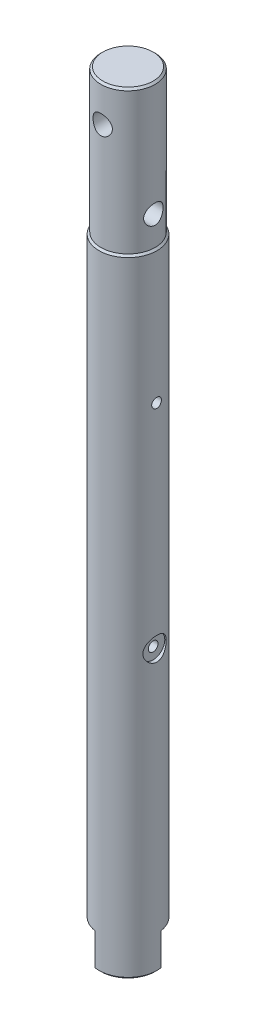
ISO-10303-21;
HEADER;
FILE_DESCRIPTION(('STEP AP214'),'2;1');
FILE_NAME('part.step','',(''),(''),'','','');
FILE_SCHEMA(('AUTOMOTIVE_DESIGN { 1 0 10303 214 1 1 1 1 }'));
ENDSEC;
DATA;
#1=APPLICATION_CONTEXT('core data for automotive mechanical design processes');
#2=APPLICATION_PROTOCOL_DEFINITION('international standard','automotive_design',2000,#1);
#3=PRODUCT_CONTEXT('',#1,'mechanical');
#4=PRODUCT('Part','Part','',(#3));
#5=PRODUCT_RELATED_PRODUCT_CATEGORY('part','',(#4));
#6=PRODUCT_DEFINITION_FORMATION('','',#4);
#7=PRODUCT_DEFINITION_CONTEXT('part definition',#1,'design');
#8=PRODUCT_DEFINITION('design','',#6,#7);
#9=PRODUCT_DEFINITION_SHAPE('','',#8);
#10=(LENGTH_UNIT() NAMED_UNIT(*) SI_UNIT(.MILLI.,.METRE.));
#11=(NAMED_UNIT(*) PLANE_ANGLE_UNIT() SI_UNIT($,.RADIAN.));
#12=(NAMED_UNIT(*) SI_UNIT($,.STERADIAN.) SOLID_ANGLE_UNIT());
#13=UNCERTAINTY_MEASURE_WITH_UNIT(LENGTH_MEASURE(1.E-05),#10,'distance_accuracy_value','');
#14=(GEOMETRIC_REPRESENTATION_CONTEXT(3) GLOBAL_UNCERTAINTY_ASSIGNED_CONTEXT((#13)) GLOBAL_UNIT_ASSIGNED_CONTEXT((#10,
#11,#12)) REPRESENTATION_CONTEXT('',''));
#15=CARTESIAN_POINT('',(0.,0.,0.));
#16=DIRECTION('',(0.,0.,1.));
#17=DIRECTION('',(1.,0.,0.));
#18=AXIS2_PLACEMENT_3D('',#15,#16,#17);
#19=CARTESIAN_POINT('',(0.,-60.,0.));
#20=DIRECTION('',(0.,-1.,0.));
#21=DIRECTION('',(0.,0.,-1.));
#22=AXIS2_PLACEMENT_3D('',#19,#20,#21);
#23=CYLINDRICAL_SURFACE('',#22,14.95);
#24=DIRECTION('',(0.,-1.,0.));
#25=VECTOR('',#24,1.);
#26=CARTESIAN_POINT('',(14.7901406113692,-60.,-2.18042213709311));
#27=LINE('',#26,#25);
#28=CARTESIAN_POINT('',(14.7901406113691,-280.5,-2.18042213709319));
#29=VERTEX_POINT('',#28);
#30=CARTESIAN_POINT('',(14.7901406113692,-297.05,-2.18042213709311));
#31=VERTEX_POINT('',#30);
#32=EDGE_CURVE('E145',#29,#31,#27,.T.);
#33=ORIENTED_EDGE('',*,*,#32,.F.);
#34=CARTESIAN_POINT('',(0.,-280.5,0.));
#35=DIRECTION('',(0.,1.,0.));
#36=DIRECTION('',(0.,0.,1.));
#37=AXIS2_PLACEMENT_3D('',#34,#35,#36);
#38=CIRCLE('',#37,14.95);
#39=CARTESIAN_POINT('',(2.18042213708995,-280.5,-14.7901406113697));
#40=VERTEX_POINT('',#39);
#41=EDGE_CURVE('E11',#29,#40,#38,.T.);
#42=ORIENTED_EDGE('',*,*,#41,.T.);
#43=DIRECTION('',(0.,-1.,0.));
#44=VECTOR('',#43,1.);
#45=CARTESIAN_POINT('',(2.18042213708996,-60.,-14.7901406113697));
#46=LINE('',#45,#44);
#47=CARTESIAN_POINT('',(2.18042213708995,-297.05,-14.7901406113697));
#48=VERTEX_POINT('',#47);
#49=EDGE_CURVE('E156',#40,#48,#46,.T.);
#50=ORIENTED_EDGE('',*,*,#49,.T.);
#51=CARTESIAN_POINT('',(0.,-297.05,0.));
#52=DIRECTION('',(0.,-1.,0.));
#53=DIRECTION('',(0.,0.,-1.));
#54=AXIS2_PLACEMENT_3D('',#51,#52,#53);
#55=CIRCLE('',#54,14.95);
#56=CARTESIAN_POINT('',(-14.7901406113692,-297.05,2.18042213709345));
#57=VERTEX_POINT('',#56);
#58=EDGE_CURVE('E197',#57,#48,#55,.T.);
#59=ORIENTED_EDGE('',*,*,#58,.F.);
#60=DIRECTION('',(0.,-1.,0.));
#61=VECTOR('',#60,1.);
#62=CARTESIAN_POINT('',(-14.7901406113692,-60.,2.18042213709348));
#63=LINE('',#62,#61);
#64=CARTESIAN_POINT('',(-14.7901406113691,-280.5,2.18042213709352));
#65=VERTEX_POINT('',#64);
#66=EDGE_CURVE('E260',#65,#57,#63,.T.);
#67=ORIENTED_EDGE('',*,*,#66,.F.);
#68=CARTESIAN_POINT('',(0.,-280.5,0.));
#69=DIRECTION('',(0.,-1.,0.));
#70=DIRECTION('',(0.,0.,-1.));
#71=AXIS2_PLACEMENT_3D('',#68,#69,#70);
#72=CIRCLE('',#71,14.95);
#73=CARTESIAN_POINT('',(-2.1804221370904,-280.5,14.7901406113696));
#74=VERTEX_POINT('',#73);
#75=EDGE_CURVE('E253',#74,#65,#72,.T.);
#76=ORIENTED_EDGE('',*,*,#75,.F.);
#77=DIRECTION('',(0.,-1.,0.));
#78=VECTOR('',#77,1.);
#79=CARTESIAN_POINT('',(-2.18042213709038,-60.,14.7901406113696));
#80=LINE('',#79,#78);
#81=CARTESIAN_POINT('',(-2.18042213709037,-297.05,14.7901406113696));
#82=VERTEX_POINT('',#81);
#83=EDGE_CURVE('E261',#74,#82,#80,.T.);
#84=ORIENTED_EDGE('',*,*,#83,.T.);
#85=EDGE_CURVE('E176',#31,#82,#55,.T.);
#86=ORIENTED_EDGE('',*,*,#85,.F.);
#87=EDGE_LOOP('',(#33,#42,#50,#59,#67,#76,#84,#86));
#88=FACE_BOUND('',#87,.T.);
#89=CARTESIAN_POINT('',(0.,25.0500000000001,0.));
#90=DIRECTION('',(0.,-1.,0.));
#91=DIRECTION('',(0.,0.,-1.));
#92=AXIS2_PLACEMENT_3D('',#89,#90,#91);
#93=CIRCLE('',#92,14.9499999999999);
#94=CARTESIAN_POINT('',(0.,25.0500000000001,-14.9499999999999));
#95=VERTEX_POINT('',#94);
#96=EDGE_CURVE('E200',#95,#95,#93,.T.);
#97=ORIENTED_EDGE('',*,*,#96,.T.);
#98=EDGE_LOOP('',(#97));
#99=FACE_BOUND('',#98,.T.);
#100=CARTESIAN_POINT('',(14.7394877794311,-43.,-2.5));
#101=CARTESIAN_POINT('',(14.7394903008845,-43.1393686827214,-2.49999440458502));
#102=CARTESIAN_POINT('',(14.7414858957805,-43.2788133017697,-2.48830635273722));
#103=CARTESIAN_POINT('',(14.7492453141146,-43.5537894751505,-2.4418835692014));
#104=CARTESIAN_POINT('',(14.7550126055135,-43.6893173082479,-2.40712762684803));
#105=CARTESIAN_POINT('',(14.7696443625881,-43.9524406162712,-2.31565025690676));
#106=CARTESIAN_POINT('',(14.7785062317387,-44.0800426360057,-2.25894723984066));
#107=CARTESIAN_POINT('',(14.7983255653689,-44.3239081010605,-2.12523122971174));
#108=CARTESIAN_POINT('',(14.8092827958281,-44.4401728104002,-2.04822050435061));
#109=CARTESIAN_POINT('',(14.8321797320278,-44.6592306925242,-1.87526001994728));
#110=CARTESIAN_POINT('',(14.8441272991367,-44.7618950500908,-1.77914813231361));
#111=CARTESIAN_POINT('',(14.8675888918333,-44.9497190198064,-1.57106394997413));
#112=CARTESIAN_POINT('',(14.8791028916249,-45.0348775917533,-1.45909071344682));
#113=CARTESIAN_POINT('',(14.9004832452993,-45.1857563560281,-1.22162742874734));
#114=CARTESIAN_POINT('',(14.9103392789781,-45.2513566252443,-1.09606017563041));
#115=CARTESIAN_POINT('',(14.9272056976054,-45.3604857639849,-0.835496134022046));
#116=CARTESIAN_POINT('',(14.9342162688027,-45.404016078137,-0.700499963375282));
#117=CARTESIAN_POINT('',(14.944546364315,-45.4673755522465,-0.426241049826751));
#118=CARTESIAN_POINT('',(14.9478995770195,-45.4874211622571,-0.287029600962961));
#119=CARTESIAN_POINT('',(14.9506528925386,-45.5039153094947,-0.00718159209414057));
#120=CARTESIAN_POINT('',(14.9500532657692,-45.5003654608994,0.133454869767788));
#121=CARTESIAN_POINT('',(14.9449951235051,-45.4699381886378,0.41068071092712));
#122=CARTESIAN_POINT('',(14.9405751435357,-45.443293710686,0.547296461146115));
#123=CARTESIAN_POINT('',(14.9284159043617,-45.367800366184,0.814090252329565));
#124=CARTESIAN_POINT('',(14.920676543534,-45.3189508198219,0.944268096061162));
#125=CARTESIAN_POINT('',(14.9026825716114,-45.2002027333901,1.19518313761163));
#126=CARTESIAN_POINT('',(14.8924165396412,-45.1302082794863,1.31587409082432));
#127=CARTESIAN_POINT('',(14.8705096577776,-44.9712275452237,1.54388537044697));
#128=CARTESIAN_POINT('',(14.8588686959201,-44.8822397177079,1.65120460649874));
#129=CARTESIAN_POINT('',(14.8353386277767,-44.6865064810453,1.85080244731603));
#130=CARTESIAN_POINT('',(14.8234482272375,-44.5795574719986,1.94288135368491));
#131=CARTESIAN_POINT('',(14.8008968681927,-44.3516235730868,2.10781953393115));
#132=CARTESIAN_POINT('',(14.7902359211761,-44.2306385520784,2.18067862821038));
#133=CARTESIAN_POINT('',(14.7713498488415,-43.9778344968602,2.30514869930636));
#134=CARTESIAN_POINT('',(14.7631274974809,-43.8460033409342,2.35673550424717));
#135=CARTESIAN_POINT('',(14.750095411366,-43.5753785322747,2.43697637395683));
#136=CARTESIAN_POINT('',(14.7452853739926,-43.4365854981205,2.46563247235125));
#137=CARTESIAN_POINT('',(14.7396811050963,-43.1577638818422,2.49891702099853));
#138=CARTESIAN_POINT('',(14.7388392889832,-43.0177702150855,2.50383020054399));
#139=CARTESIAN_POINT('',(14.7411400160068,-42.7389608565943,2.49024831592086));
#140=CARTESIAN_POINT('',(14.7442824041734,-42.6001451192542,2.47175416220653));
#141=CARTESIAN_POINT('',(14.754153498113,-42.3285373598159,2.4121253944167));
#142=CARTESIAN_POINT('',(14.760859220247,-42.1957125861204,2.37113582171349));
#143=CARTESIAN_POINT('',(14.7770821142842,-41.9388174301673,2.2678319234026));
#144=CARTESIAN_POINT('',(14.7865994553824,-41.8147475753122,2.20551631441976));
#145=CARTESIAN_POINT('',(14.8074837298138,-41.5776172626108,2.06065767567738));
#146=CARTESIAN_POINT('',(14.8188670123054,-41.4646696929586,1.97793224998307));
#147=CARTESIAN_POINT('',(14.8421527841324,-41.254157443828,1.79485248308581));
#148=CARTESIAN_POINT('',(14.8540553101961,-41.1565938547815,1.69449689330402));
#149=CARTESIAN_POINT('',(14.8771890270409,-40.9785787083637,1.47774379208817));
#150=CARTESIAN_POINT('',(14.8884118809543,-40.8983170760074,1.36118927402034));
#151=CARTESIAN_POINT('',(14.908787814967,-40.758514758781,1.11608549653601));
#152=CARTESIAN_POINT('',(14.9179409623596,-40.6989734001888,0.987536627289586));
#153=CARTESIAN_POINT('',(14.9331099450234,-40.602597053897,0.722656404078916));
#154=CARTESIAN_POINT('',(14.9391394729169,-40.5656628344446,0.586361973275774));
#155=CARTESIAN_POINT('',(14.9474397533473,-40.5152297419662,0.30939589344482));
#156=CARTESIAN_POINT('',(14.9497108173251,-40.5017289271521,0.168724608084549));
#157=CARTESIAN_POINT('',(14.9502338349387,-40.4986020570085,-0.111169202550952));
#158=CARTESIAN_POINT('',(14.9485344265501,-40.5086870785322,-0.250388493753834));
#159=CARTESIAN_POINT('',(14.9414067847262,-40.5518204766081,-0.525120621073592));
#160=CARTESIAN_POINT('',(14.9359785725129,-40.5848687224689,-0.66063347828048));
#161=CARTESIAN_POINT('',(14.9220011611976,-40.6728793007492,-0.923994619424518));
#162=CARTESIAN_POINT('',(14.9134554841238,-40.7278169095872,-1.05185136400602));
#163=CARTESIAN_POINT('',(14.8941758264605,-40.8580145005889,-1.2965769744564));
#164=CARTESIAN_POINT('',(14.8834417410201,-40.9332754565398,-1.41344531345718));
#165=CARTESIAN_POINT('',(14.8608191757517,-41.1030068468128,-1.63433167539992));
#166=CARTESIAN_POINT('',(14.8489188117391,-41.1976887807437,-1.73818598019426));
#167=CARTESIAN_POINT('',(14.8253870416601,-41.4031307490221,-1.92863445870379));
#168=CARTESIAN_POINT('',(14.8137556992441,-41.5138945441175,-2.01522458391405));
#169=CARTESIAN_POINT('',(14.7919893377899,-41.7492934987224,-2.1692540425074));
#170=CARTESIAN_POINT('',(14.7818655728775,-41.8740218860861,-2.23655250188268));
#171=CARTESIAN_POINT('',(14.7643936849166,-42.1331318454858,-2.3491387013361));
#172=CARTESIAN_POINT('',(14.7570427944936,-42.2675036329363,-2.39444839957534));
#173=CARTESIAN_POINT('',(14.7475767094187,-42.5019962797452,-2.45194668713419));
#174=CARTESIAN_POINT('',(14.7445602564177,-42.6006984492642,-2.46993771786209));
#175=CARTESIAN_POINT('',(14.7405149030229,-42.799587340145,-2.49396627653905));
#176=CARTESIAN_POINT('',(14.7394859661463,-42.8997740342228,-2.50000402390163));
#177=CARTESIAN_POINT('',(14.7394877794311,-43.,-2.5));
#178=B_SPLINE_CURVE_WITH_KNOTS('',3,(#100,#101,#102,#103,#104,#105,#106,#107,#108,#109,#110,
#111,#112,#113,#114,#115,#116,#117,#118,#119,#120,#121,#122,#123,#124,#125,#126,#127,#128,#129,
#130,#131,#132,#133,#134,#135,#136,#137,#138,#139,#140,#141,#142,#143,#144,#145,#146,#147,#148,
#149,#150,#151,#152,#153,#154,#155,#156,#157,#158,#159,#160,#161,#162,#163,#164,#165,#166,#167,
#168,#169,#170,#171,#172,#173,#174,#175,#176,#177),.UNSPECIFIED.,.T.,.F.,(4,2,2,2,2,2,2,2,2,2,2,
2,2,2,2,2,2,2,2,2,2,2,2,2,2,2,2,2,2,2,2,2,2,2,2,2,2,2,4),(0.,0.417739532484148,0.83586370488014,
1.25363788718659,1.6713654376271,2.09280294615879,2.51426548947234,2.93826148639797,
3.36222972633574,3.78225887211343,4.20225928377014,4.61807198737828,5.03389742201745,
5.45163811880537,5.86941285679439,6.29228987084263,6.71517083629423,7.13853100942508,
7.56185363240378,7.98008687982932,8.39830386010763,8.81385549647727,9.22943214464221,
9.64886647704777,10.0683305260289,10.4921878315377,10.91603135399,11.3380008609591,
11.7599354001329,12.176728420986,12.5935190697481,13.00984029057,13.4261814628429,
13.847323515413,14.2685642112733,14.6928068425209,15.1166249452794,15.4170447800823,
15.7174591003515),.UNSPECIFIED.);
#179=CARTESIAN_POINT('',(14.7394877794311,-43.,-2.5));
#180=VERTEX_POINT('',#179);
#181=EDGE_CURVE('E115',#180,#180,#178,.T.);
#182=ORIENTED_EDGE('',*,*,#181,.T.);
#183=EDGE_LOOP('',(#182));
#184=FACE_BOUND('',#183,.T.);
#185=CARTESIAN_POINT('',(13.6931552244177,-153.,-6.));
#186=CARTESIAN_POINT('',(13.6931561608,-152.839320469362,-5.99999905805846));
#187=CARTESIAN_POINT('',(13.6959931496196,-152.678576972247,-5.99353608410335));
#188=CARTESIAN_POINT('',(13.7072494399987,-152.358248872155,-5.96774710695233));
#189=CARTESIAN_POINT('',(13.7156725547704,-152.198665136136,-5.94841231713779));
#190=CARTESIAN_POINT('',(13.7378430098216,-151.881564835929,-5.89702913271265));
#191=CARTESIAN_POINT('',(13.7516020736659,-151.724053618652,-5.86495273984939));
#192=CARTESIAN_POINT('',(13.7839963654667,-151.412525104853,-5.78840808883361));
#193=CARTESIAN_POINT('',(13.8026336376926,-151.2585093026,-5.74393463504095));
#194=CARTESIAN_POINT('',(13.8441059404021,-150.955700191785,-5.64324195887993));
#195=CARTESIAN_POINT('',(13.8669224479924,-150.806887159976,-5.58707442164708));
#196=CARTESIAN_POINT('',(13.9161291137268,-150.514656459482,-5.46335751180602));
#197=CARTESIAN_POINT('',(13.9425206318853,-150.371240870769,-5.39580380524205));
#198=CARTESIAN_POINT('',(14.0259137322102,-149.950554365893,-5.17693494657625));
#199=CARTESIAN_POINT('',(14.0871917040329,-149.68244437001,-5.0092781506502));
#200=CARTESIAN_POINT('',(14.2181509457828,-149.163353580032,-4.6249143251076));
#201=CARTESIAN_POINT('',(14.2881039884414,-148.913999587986,-4.40610224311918));
#202=CARTESIAN_POINT('',(14.3916849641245,-148.569412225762,-4.04936111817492));
#203=CARTESIAN_POINT('',(14.4260102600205,-148.459391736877,-3.92559892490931));
#204=CARTESIAN_POINT('',(14.4933428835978,-148.249807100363,-3.66920283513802));
#205=CARTESIAN_POINT('',(14.5263506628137,-148.150239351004,-3.53657202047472));
#206=CARTESIAN_POINT('',(14.5914860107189,-147.958429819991,-3.25766226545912));
#207=CARTESIAN_POINT('',(14.6235247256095,-147.866644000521,-3.11104889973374));
#208=CARTESIAN_POINT('',(14.6843481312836,-147.695855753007,-2.80998045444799));
#209=CARTESIAN_POINT('',(14.7131340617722,-147.616848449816,-2.65552839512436));
#210=CARTESIAN_POINT('',(14.7666358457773,-147.472293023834,-2.33978603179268));
#211=CARTESIAN_POINT('',(14.7913521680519,-147.406743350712,-2.178496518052));
#212=CARTESIAN_POINT('',(14.8359882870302,-147.289748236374,-1.8502374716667));
#213=CARTESIAN_POINT('',(14.8559083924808,-147.238301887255,-1.68326830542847));
#214=CARTESIAN_POINT('',(14.8895109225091,-147.152220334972,-1.35319311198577));
#215=CARTESIAN_POINT('',(14.9034497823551,-147.116888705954,-1.19029467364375));
#216=CARTESIAN_POINT('',(14.9260496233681,-147.059869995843,-0.86176897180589));
#217=CARTESIAN_POINT('',(14.9347109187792,-147.038182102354,-0.696141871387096));
#218=CARTESIAN_POINT('',(14.9465062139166,-147.008695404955,-0.363510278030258));
#219=CARTESIAN_POINT('',(14.9496418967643,-147.000892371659,-0.196506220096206));
#220=CARTESIAN_POINT('',(14.950300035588,-146.999252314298,0.13757878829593));
#221=CARTESIAN_POINT('',(14.9478226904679,-147.005414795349,0.304659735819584));
#222=CARTESIAN_POINT('',(14.9376265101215,-147.030886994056,0.62808594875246));
#223=CARTESIAN_POINT('',(14.9302133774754,-147.049430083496,0.784501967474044));
#224=CARTESIAN_POINT('',(14.9106460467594,-147.098697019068,1.09515460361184));
#225=CARTESIAN_POINT('',(14.8984903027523,-147.129424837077,1.24939049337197));
#226=CARTESIAN_POINT('',(14.8697480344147,-147.202755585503,1.55453288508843));
#227=CARTESIAN_POINT('',(14.853162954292,-147.245354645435,1.70544045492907));
#228=CARTESIAN_POINT('',(14.8159621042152,-147.342065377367,2.00306574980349));
#229=CARTESIAN_POINT('',(14.7953448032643,-147.39618142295,2.14978185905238));
#230=CARTESIAN_POINT('',(14.7502468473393,-147.516348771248,2.44020924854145));
#231=CARTESIAN_POINT('',(14.7257139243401,-147.582563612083,2.58384480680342));
#232=CARTESIAN_POINT('',(14.6736007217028,-147.725864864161,2.86503566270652));
#233=CARTESIAN_POINT('',(14.6460193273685,-147.802955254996,3.00258871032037));
#234=CARTESIAN_POINT('',(14.5596711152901,-148.049711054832,3.40492622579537));
#235=CARTESIAN_POINT('',(14.4972694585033,-148.234940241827,3.65957913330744));
#236=CARTESIAN_POINT('',(14.3642730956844,-148.655790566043,4.15205599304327));
#237=CARTESIAN_POINT('',(14.293409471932,-148.893931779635,4.38765789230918));
#238=CARTESIAN_POINT('',(14.1894078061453,-149.278168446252,4.70913612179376));
#239=CARTESIAN_POINT('',(14.1551001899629,-149.410851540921,4.8110335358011));
#240=CARTESIAN_POINT('',(14.0881938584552,-149.68453704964,5.00356484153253));
#241=CARTESIAN_POINT('',(14.0555945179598,-149.825536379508,5.09420287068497));
#242=CARTESIAN_POINT('',(13.9921358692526,-150.119284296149,5.26604942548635));
#243=CARTESIAN_POINT('',(13.9613548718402,-150.272255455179,5.34690651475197));
#244=CARTESIAN_POINT('',(13.9036105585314,-150.585148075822,5.4953119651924));
#245=CARTESIAN_POINT('',(13.8766456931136,-150.745066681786,5.56286573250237));
#246=CARTESIAN_POINT('',(13.8274574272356,-151.070757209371,5.68403029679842));
#247=CARTESIAN_POINT('',(13.8052325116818,-151.236527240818,5.73764555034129));
#248=CARTESIAN_POINT('',(13.7663283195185,-151.572710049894,5.83037214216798));
#249=CARTESIAN_POINT('',(13.7496485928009,-151.743122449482,5.86948465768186));
#250=CARTESIAN_POINT('',(13.7233092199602,-152.07662040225,5.93079473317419));
#251=CARTESIAN_POINT('',(13.7132814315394,-152.239513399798,5.95388339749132));
#252=CARTESIAN_POINT('',(13.6990271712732,-152.566894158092,5.98660809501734));
#253=CARTESIAN_POINT('',(13.6948003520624,-152.731381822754,5.9962449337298));
#254=CARTESIAN_POINT('',(13.6923001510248,-153.060594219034,6.00195184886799));
#255=CARTESIAN_POINT('',(13.694025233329,-153.22531887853,5.99802542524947));
#256=CARTESIAN_POINT('',(13.7033632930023,-153.553717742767,5.97666045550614));
#257=CARTESIAN_POINT('',(13.7109761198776,-153.717391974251,5.95922225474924));
#258=CARTESIAN_POINT('',(13.731213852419,-154.033001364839,5.91243359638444));
#259=CARTESIAN_POINT('',(13.7435237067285,-154.18506833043,5.88382973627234));
#260=CARTESIAN_POINT('',(13.7727533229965,-154.486167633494,5.81508040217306));
#261=CARTESIAN_POINT('',(13.7896745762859,-154.635198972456,5.77493119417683));
#262=CARTESIAN_POINT('',(13.8276221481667,-154.929219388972,5.68346842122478));
#263=CARTESIAN_POINT('',(13.8486476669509,-155.074209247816,5.63215703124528));
#264=CARTESIAN_POINT('',(13.8942234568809,-155.359400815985,5.51876677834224));
#265=CARTESIAN_POINT('',(13.9187750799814,-155.499600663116,5.4566837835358));
#266=CARTESIAN_POINT('',(13.9717918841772,-155.779959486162,5.31950676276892));
#267=CARTESIAN_POINT('',(14.0003749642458,-155.919888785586,5.24398898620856));
#268=CARTESIAN_POINT('',(14.0598710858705,-156.192999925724,5.08231682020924));
#269=CARTESIAN_POINT('',(14.0907849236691,-156.32617943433,4.99615878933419));
#270=CARTESIAN_POINT('',(14.1541375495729,-156.585090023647,4.81375224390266));
#271=CARTESIAN_POINT('',(14.186576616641,-156.71081973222,4.71750187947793));
#272=CARTESIAN_POINT('',(14.2521679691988,-156.95417822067,4.51547198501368));
#273=CARTESIAN_POINT('',(14.2853202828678,-157.071806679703,4.40969207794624));
#274=CARTESIAN_POINT('',(14.354014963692,-157.306832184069,4.18091616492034));
#275=CARTESIAN_POINT('',(14.389550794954,-157.42355500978,4.05722433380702));
#276=CARTESIAN_POINT('',(14.4595415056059,-157.646181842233,3.80024812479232));
#277=CARTESIAN_POINT('',(14.4939967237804,-157.752089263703,3.66696679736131));
#278=CARTESIAN_POINT('',(14.5609208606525,-157.952457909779,3.39148658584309));
#279=CARTESIAN_POINT('',(14.5933888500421,-158.046913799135,3.24928359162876));
#280=CARTESIAN_POINT('',(14.6554202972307,-158.223569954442,2.95693614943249));
#281=CARTESIAN_POINT('',(14.6849850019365,-158.305775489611,2.80679515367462));
#282=CARTESIAN_POINT('',(14.7404165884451,-158.457321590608,2.49940322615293));
#283=CARTESIAN_POINT('',(14.7662817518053,-158.526656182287,2.34214903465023));
#284=CARTESIAN_POINT('',(14.813549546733,-158.651734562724,2.02174605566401));
#285=CARTESIAN_POINT('',(14.8349540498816,-158.707484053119,1.85859977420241));
#286=CARTESIAN_POINT('',(14.8726817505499,-158.804840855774,1.52760388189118));
#287=CARTESIAN_POINT('',(14.8890061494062,-158.846451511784,1.3597553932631));
#288=CARTESIAN_POINT('',(14.9160876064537,-158.915079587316,1.02066184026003));
#289=CARTESIAN_POINT('',(14.9268450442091,-158.942098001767,0.849417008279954));
#290=CARTESIAN_POINT('',(14.941951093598,-158.979939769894,0.516285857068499));
#291=CARTESIAN_POINT('',(14.9466741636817,-158.991710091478,0.354523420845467));
#292=CARTESIAN_POINT('',(14.9508466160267,-159.00211118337,0.0305106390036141));
#293=CARTESIAN_POINT('',(14.9502961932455,-159.00074243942,-0.1317396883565));
#294=CARTESIAN_POINT('',(14.9439371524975,-158.984881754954,-0.455467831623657));
#295=CARTESIAN_POINT('',(14.9381293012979,-158.970391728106,-0.616945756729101));
#296=CARTESIAN_POINT('',(14.9214141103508,-158.928445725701,-0.937939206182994));
#297=CARTESIAN_POINT('',(14.9105067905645,-158.900989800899,-1.09745473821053));
#298=CARTESIAN_POINT('',(14.8843029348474,-158.834455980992,-1.40840593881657));
#299=CARTESIAN_POINT('',(14.8691546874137,-158.795769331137,-1.55993814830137));
#300=CARTESIAN_POINT('',(14.8347155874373,-158.706835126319,-1.85913931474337));
#301=CARTESIAN_POINT('',(14.8154233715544,-158.656583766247,-2.00680698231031));
#302=CARTESIAN_POINT('',(14.7731675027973,-158.544965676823,-2.29729455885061));
#303=CARTESIAN_POINT('',(14.750204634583,-158.483601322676,-2.44011549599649));
#304=CARTESIAN_POINT('',(14.7011334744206,-158.350203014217,-2.72018329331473));
#305=CARTESIAN_POINT('',(14.6750239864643,-158.278165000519,-2.85742800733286));
#306=CARTESIAN_POINT('',(14.619059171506,-158.120552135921,-3.13145570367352));
#307=CARTESIAN_POINT('',(14.5890896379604,-158.034521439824,-3.26795320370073));
#308=CARTESIAN_POINT('',(14.5271040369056,-157.851971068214,-3.5333162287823));
#309=CARTESIAN_POINT('',(14.4950872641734,-157.755447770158,-3.66217909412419));
#310=CARTESIAN_POINT('',(14.4297882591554,-157.552528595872,-3.91156343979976));
#311=CARTESIAN_POINT('',(14.3965058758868,-157.446131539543,-4.03208392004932));
#312=CARTESIAN_POINT('',(14.3294865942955,-157.224084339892,-4.26414152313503));
#313=CARTESIAN_POINT('',(14.2957496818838,-157.108433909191,-4.37567836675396));
#314=CARTESIAN_POINT('',(14.2265528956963,-156.860994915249,-4.59584907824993));
#315=CARTESIAN_POINT('',(14.1911171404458,-156.728649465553,-4.70386569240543));
#316=CARTESIAN_POINT('',(14.1216943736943,-156.455033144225,-4.90835070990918));
#317=CARTESIAN_POINT('',(14.0877068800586,-156.313765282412,-5.00482297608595));
#318=CARTESIAN_POINT('',(14.0221469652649,-156.022943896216,-5.18566851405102));
#319=CARTESIAN_POINT('',(13.9905769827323,-155.873382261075,-5.27002964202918));
#320=CARTESIAN_POINT('',(13.9308971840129,-155.567088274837,-5.42582377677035));
#321=CARTESIAN_POINT('',(13.9027857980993,-155.410359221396,-5.4972626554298));
#322=CARTESIAN_POINT('',(13.8511712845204,-155.092099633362,-5.62604020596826));
#323=CARTESIAN_POINT('',(13.827630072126,-154.930622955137,-5.683496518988));
#324=CARTESIAN_POINT('',(13.785683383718,-154.602800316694,-5.78449894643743));
#325=CARTESIAN_POINT('',(13.7672754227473,-154.43645675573,-5.82805179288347));
#326=CARTESIAN_POINT('',(13.7362980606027,-154.100579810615,-5.90069262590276));
#327=CARTESIAN_POINT('',(13.7237131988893,-153.931056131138,-5.92981893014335));
#328=CARTESIAN_POINT('',(13.7047981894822,-153.589876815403,-5.97340596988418));
#329=CARTESIAN_POINT('',(13.6984630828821,-153.418222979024,-5.98787833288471));
#330=CARTESIAN_POINT('',(13.6946318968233,-153.205263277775,-5.99662873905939));
#331=CARTESIAN_POINT('',(13.6940784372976,-153.164224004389,-5.99789266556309));
#332=CARTESIAN_POINT('',(13.6933399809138,-153.082124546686,-5.99957841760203));
#333=CARTESIAN_POINT('',(13.6931549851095,-153.041064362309,-6.00000024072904));
#334=CARTESIAN_POINT('',(13.6931552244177,-153.,-6.));
#335=B_SPLINE_CURVE_WITH_KNOTS('',3,(#185,#186,#187,#188,#189,#190,#191,#192,#193,#194,#195,
#196,#197,#198,#199,#200,#201,#202,#203,#204,#205,#206,#207,#208,#209,#210,#211,#212,#213,#214,
#215,#216,#217,#218,#219,#220,#221,#222,#223,#224,#225,#226,#227,#228,#229,#230,#231,#232,#233,
#234,#235,#236,#237,#238,#239,#240,#241,#242,#243,#244,#245,#246,#247,#248,#249,#250,#251,#252,
#253,#254,#255,#256,#257,#258,#259,#260,#261,#262,#263,#264,#265,#266,#267,#268,#269,#270,#271,
#272,#273,#274,#275,#276,#277,#278,#279,#280,#281,#282,#283,#284,#285,#286,#287,#288,#289,#290,
#291,#292,#293,#294,#295,#296,#297,#298,#299,#300,#301,#302,#303,#304,#305,#306,#307,#308,#309,
#310,#311,#312,#313,#314,#315,#316,#317,#318,#319,#320,#321,#322,#323,#324,#325,#326,#327,#328,
#329,#330,#331,#332,#333,#334),.UNSPECIFIED.,.T.,.F.,(4,2,2,2,2,2,2,2,2,2,2,2,2,2,2,2,2,2,2,2,2,
2,2,2,2,2,2,2,2,2,2,2,2,2,2,2,2,2,2,2,2,2,2,2,2,2,2,2,2,2,2,2,2,2,2,2,2,2,2,2,2,2,2,2,2,2,2,2,2,
2,2,2,2,2,4),(0.,0.481995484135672,0.964320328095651,1.44771094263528,1.93130445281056,
2.41280431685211,2.89448787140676,3.85659446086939,4.86896779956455,5.375849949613,
5.88255686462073,6.40965166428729,6.93654489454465,7.46337739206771,7.99017596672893,
8.4913311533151,8.99245649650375,9.49342916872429,9.9943840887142,10.4668853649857,
10.9395407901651,11.4120422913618,11.8847235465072,12.364343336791,12.8441390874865,
13.8031131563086,14.8254189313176,15.3372728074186,15.8489380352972,16.3755026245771,
16.9018527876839,17.4280344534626,17.9541733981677,18.4480083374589,18.9418137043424,
19.4354916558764,19.9291569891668,20.3942951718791,20.8595839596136,21.3247821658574,
21.7901592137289,22.2743045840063,22.7586161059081,23.2430165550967,23.7274361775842,
24.248057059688,24.7685130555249,25.2892106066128,25.8096835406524,26.330397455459,
26.8508924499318,27.3712642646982,27.891600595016,28.3777682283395,28.8639178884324,
29.3499966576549,29.8360735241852,30.3069150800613,30.7779117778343,31.2488079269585,
31.7198836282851,32.2116663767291,32.7036194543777,33.195631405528,33.6876586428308,
34.2104412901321,34.733048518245,35.2561761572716,35.7790654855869,36.2973903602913,
36.8154638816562,37.3321538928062,37.8484336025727,37.9716153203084,38.0947973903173),.UNSPECIFIED.);
#336=CARTESIAN_POINT('',(13.6931552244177,-153.,-6.));
#337=VERTEX_POINT('',#336);
#338=EDGE_CURVE('E21',#337,#337,#335,.T.);
#339=ORIENTED_EDGE('',*,*,#338,.F.);
#340=EDGE_LOOP('',(#339));
#341=FACE_BOUND('',#340,.T.);
#342=ADVANCED_FACE('F17',(#88,#99,#184,#341),#23,.T.);
#343=CARTESIAN_POINT('',(0.,-297.05,0.));
#344=DIRECTION('',(0.,1.,0.));
#345=DIRECTION('',(0.,0.,1.));
#346=AXIS2_PLACEMENT_3D('',#343,#344,#345);
#347=CONICAL_SURFACE('',#346,14.95,0.785398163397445);
#348=CARTESIAN_POINT('',(27.5780281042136,-282.452310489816,10.6074653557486));
#349=CARTESIAN_POINT('',(27.2974749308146,-282.814867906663,10.3269121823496));
#350=CARTESIAN_POINT('',(27.0164645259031,-283.176719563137,10.0459017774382));
#351=CARTESIAN_POINT('',(26.4533945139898,-283.89879309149,9.48283176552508));
#352=CARTESIAN_POINT('',(26.1713348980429,-284.259014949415,9.20077214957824));
#353=CARTESIAN_POINT('',(25.6059667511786,-284.977693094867,8.63540400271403));
#354=CARTESIAN_POINT('',(25.3226579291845,-285.336148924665,8.35209518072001));
#355=CARTESIAN_POINT('',(24.7546990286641,-286.050928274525,7.78413628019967));
#356=CARTESIAN_POINT('',(24.4700489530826,-286.407251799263,7.49948620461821));
#357=CARTESIAN_POINT('',(23.8972180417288,-287.119923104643,6.92665529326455));
#358=CARTESIAN_POINT('',(23.6090264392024,-287.476253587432,6.63846369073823));
#359=CARTESIAN_POINT('',(23.0308574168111,-288.18600515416,6.06029466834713));
#360=CARTESIAN_POINT('',(22.7408800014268,-288.539426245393,5.77031725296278));
#361=CARTESIAN_POINT('',(22.1588945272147,-289.242809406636,5.18833177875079));
#362=CARTESIAN_POINT('',(21.8668867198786,-289.592771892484,4.89632397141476));
#363=CARTESIAN_POINT('',(21.2804687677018,-290.288649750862,4.30990601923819));
#364=CARTESIAN_POINT('',(20.9860586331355,-290.634565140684,4.01549588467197));
#365=CARTESIAN_POINT('',(20.4406566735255,-291.267864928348,3.470093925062));
#366=CARTESIAN_POINT('',(20.1900704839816,-291.555947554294,3.21950773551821));
#367=CARTESIAN_POINT('',(19.686596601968,-292.128060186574,2.71603385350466));
#368=CARTESIAN_POINT('',(19.4337089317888,-292.412090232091,2.46314618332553));
#369=CARTESIAN_POINT('',(18.9251958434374,-292.975446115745,1.95463309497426));
#370=CARTESIAN_POINT('',(18.6695695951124,-293.2547704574,1.69900684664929));
#371=CARTESIAN_POINT('',(18.1552352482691,-293.807689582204,1.18467249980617));
#372=CARTESIAN_POINT('',(17.8965271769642,-294.081284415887,0.925964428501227));
#373=CARTESIAN_POINT('',(17.3758664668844,-294.621208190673,0.405303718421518));
#374=CARTESIAN_POINT('',(17.1139185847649,-294.887546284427,0.143355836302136));
#375=CARTESIAN_POINT('',(16.5858307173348,-295.411839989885,-0.384732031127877));
#376=CARTESIAN_POINT('',(16.3196905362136,-295.669795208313,-0.650872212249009));
#377=CARTESIAN_POINT('',(15.7826619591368,-296.175234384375,-1.18790078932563));
#378=CARTESIAN_POINT('',(15.5117760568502,-296.422723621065,-1.45878669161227));
#379=CARTESIAN_POINT('',(14.964348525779,-296.904806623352,-2.00621422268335));
#380=CARTESIAN_POINT('',(14.6878076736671,-297.139402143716,-2.28275507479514));
#381=CARTESIAN_POINT('',(14.1344068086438,-297.587346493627,-2.83615593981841));
#382=CARTESIAN_POINT('',(13.8576926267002,-297.801053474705,-3.11287012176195));
#383=CARTESIAN_POINT('',(13.2970885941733,-298.20900883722,-3.67347415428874));
#384=CARTESIAN_POINT('',(13.0131980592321,-298.403255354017,-3.95736468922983));
#385=CARTESIAN_POINT('',(12.4380020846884,-298.766865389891,-4.53256066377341));
#386=CARTESIAN_POINT('',(12.1467086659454,-298.936266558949,-4.8238540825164));
#387=CARTESIAN_POINT('',(11.5560442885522,-299.244268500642,-5.41451845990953));
#388=CARTESIAN_POINT('',(11.2566756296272,-299.382877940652,-5.71388711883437));
#389=CARTESIAN_POINT('',(10.70945911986,-299.599027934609,-6.26110362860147));
#390=CARTESIAN_POINT('',(10.462929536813,-299.683204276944,-6.50763321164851));
#391=CARTESIAN_POINT('',(9.96588991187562,-299.823550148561,-7.00467283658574));
#392=CARTESIAN_POINT('',(9.71538043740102,-299.879723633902,-7.25518231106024));
#393=CARTESIAN_POINT('',(9.21237385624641,-299.961195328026,-7.75818889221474));
#394=CARTESIAN_POINT('',(8.9598821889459,-299.986559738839,-8.01068055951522));
#395=CARTESIAN_POINT('',(8.45429755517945,-300.005241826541,-8.51626519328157));
#396=CARTESIAN_POINT('',(8.20120459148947,-299.998559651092,-8.76935815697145));
#397=CARTESIAN_POINT('',(7.69680431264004,-299.953555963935,-9.27375843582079));
#398=CARTESIAN_POINT('',(7.44549500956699,-299.915278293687,-9.52506773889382));
#399=CARTESIAN_POINT('',(6.94604163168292,-299.809162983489,-10.0245211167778));
#400=CARTESIAN_POINT('',(6.69789783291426,-299.741322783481,-10.2726649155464));
#401=CARTESIAN_POINT('',(6.20533351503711,-299.579002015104,-10.7652292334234));
#402=CARTESIAN_POINT('',(5.96092526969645,-299.484447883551,-11.009637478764));
#403=CARTESIAN_POINT('',(5.47720263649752,-299.272420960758,-11.4933601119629));
#404=CARTESIAN_POINT('',(5.23788806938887,-299.154948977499,-11.7326746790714));
#405=CARTESIAN_POINT('',(4.69322109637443,-298.862382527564,-12.2773416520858));
#406=CARTESIAN_POINT('',(4.38967672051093,-298.680587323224,-12.5808860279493));
#407=CARTESIAN_POINT('',(3.79092365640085,-298.291151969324,-13.1796390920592));
#408=CARTESIAN_POINT('',(3.49571945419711,-298.08349822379,-13.4748432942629));
#409=CARTESIAN_POINT('',(2.91233316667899,-297.647556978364,-14.0582295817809));
#410=CARTESIAN_POINT('',(2.62416629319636,-297.419229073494,-14.3463964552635));
#411=CARTESIAN_POINT('',(2.05453653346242,-296.946675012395,-14.9160262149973));
#412=CARTESIAN_POINT('',(1.77307252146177,-296.702451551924,-15.1974902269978));
#413=CARTESIAN_POINT('',(1.21354810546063,-296.199296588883,-15.7570146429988));
#414=CARTESIAN_POINT('',(0.935535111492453,-295.940260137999,-16.035027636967));
#415=CARTESIAN_POINT('',(0.384446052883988,-295.411900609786,-16.5861166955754));
#416=CARTESIAN_POINT('',(0.111370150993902,-295.142577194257,-16.8591925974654));
#417=CARTESIAN_POINT('',(-0.430279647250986,-294.59590356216,-17.4008423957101));
#418=CARTESIAN_POINT('',(-0.698858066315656,-294.318562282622,-17.6694208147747));
#419=CARTESIAN_POINT('',(-1.23242179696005,-293.757082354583,-18.202984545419));
#420=CARTESIAN_POINT('',(-1.49740717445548,-293.472943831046,-18.4679699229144));
#421=CARTESIAN_POINT('',(-2.13611666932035,-292.777268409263,-19.1066794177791));
#422=CARTESIAN_POINT('',(-2.5082642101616,-292.362838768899,-19.4788269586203));
#423=CARTESIAN_POINT('',(-3.24760645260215,-291.525048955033,-20.2181692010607));
#424=CARTESIAN_POINT('',(-3.61480011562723,-291.101686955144,-20.5853628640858));
#425=CARTESIAN_POINT('',(-4.33893144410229,-290.25513224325,-21.3094941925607));
#426=CARTESIAN_POINT('',(-4.69593769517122,-289.832056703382,-21.6665004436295));
#427=CARTESIAN_POINT('',(-5.22892644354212,-289.193394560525,-22.1994891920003));
#428=CARTESIAN_POINT('',(-5.40614390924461,-288.979863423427,-22.3767066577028));
#429=CARTESIAN_POINT('',(-5.7598242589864,-288.551558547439,-22.7303870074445));
#430=CARTESIAN_POINT('',(-5.9362871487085,-288.336784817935,-22.9068498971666));
#431=CARTESIAN_POINT('',(-6.11240813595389,-288.121451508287,-23.0829708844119));
#432=B_SPLINE_CURVE_WITH_KNOTS('',3,(#348,#349,#350,#351,#352,#353,#354,#355,#356,#357,#358,
#359,#360,#361,#362,#363,#364,#365,#366,#367,#368,#369,#370,#371,#372,#373,#374,#375,#376,#377,
#378,#379,#380,#381,#382,#383,#384,#385,#386,#387,#388,#389,#390,#391,#392,#393,#394,#395,#396,
#397,#398,#399,#400,#401,#402,#403,#404,#405,#406,#407,#408,#409,#410,#411,#412,#413,#414,#415,
#416,#417,#418,#419,#420,#421,#422,#423,#424,#425,#426,#427,#428,#429,#430,#431),.UNSPECIFIED.,
.F.,.F.,(4,2,2,2,2,2,2,2,2,2,2,2,2,2,2,2,2,2,2,2,2,2,2,2,2,2,2,2,2,2,2,2,2,2,2,2,2,2,2,2,2,4),
(0.,1.61239440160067,3.22480258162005,4.83760873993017,6.45041135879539,8.07450612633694,
9.6985968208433,11.3224898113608,12.9463758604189,14.3164629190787,15.6865367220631,
17.0570383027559,18.4275277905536,19.7962001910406,21.1649367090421,22.5329743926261,
23.9008254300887,25.2380447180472,26.5753920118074,27.9106913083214,29.2456142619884,
30.3206097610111,31.3954533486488,32.4679832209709,33.5405081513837,34.6115473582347,
35.6826793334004,36.7567901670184,37.8308631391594,39.2282772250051,40.6264291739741,
42.0273751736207,43.4280842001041,44.8403791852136,46.2527206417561,47.6635443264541,
49.0743420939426,51.0838503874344,53.0937736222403,55.0698549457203,56.0576110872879,
57.0453597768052),.UNSPECIFIED.);
#433=CARTESIAN_POINT('',(13.5843008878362,-298.,-3.38626186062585));
#434=VERTEX_POINT('',#433);
#435=EDGE_CURVE('E138',#31,#434,#432,.T.);
#436=ORIENTED_EDGE('',*,*,#435,.F.);
#437=ORIENTED_EDGE('',*,*,#85,.T.);
#438=CARTESIAN_POINT('',(10.6074653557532,-282.452310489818,27.5780281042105));
#439=CARTESIAN_POINT('',(10.3269121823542,-282.814867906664,27.2974749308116));
#440=CARTESIAN_POINT('',(10.0459017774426,-283.176719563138,27.0164645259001));
#441=CARTESIAN_POINT('',(9.48283176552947,-283.898793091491,26.453394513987));
#442=CARTESIAN_POINT('',(9.20077214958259,-284.259014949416,26.1713348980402));
#443=CARTESIAN_POINT('',(8.6354040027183,-284.977693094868,25.605966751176));
#444=CARTESIAN_POINT('',(8.35209518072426,-285.336148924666,25.3226579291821));
#445=CARTESIAN_POINT('',(7.78413628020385,-286.050928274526,24.7546990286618));
#446=CARTESIAN_POINT('',(7.49948620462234,-286.407251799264,24.4700489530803));
#447=CARTESIAN_POINT('',(6.9266552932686,-287.119923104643,23.8972180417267));
#448=CARTESIAN_POINT('',(6.63846369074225,-287.476253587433,23.6090264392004));
#449=CARTESIAN_POINT('',(6.0602946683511,-288.186005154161,23.0308574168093));
#450=CARTESIAN_POINT('',(5.77031725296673,-288.539426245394,22.740880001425));
#451=CARTESIAN_POINT('',(5.18833177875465,-289.242809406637,22.1588945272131));
#452=CARTESIAN_POINT('',(4.89632397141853,-289.592771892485,21.8668867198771));
#453=CARTESIAN_POINT('',(4.30990601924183,-290.288649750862,21.2804687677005));
#454=CARTESIAN_POINT('',(4.01549588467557,-290.634565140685,20.9860586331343));
#455=CARTESIAN_POINT('',(3.47009392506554,-291.267864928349,20.4406566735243));
#456=CARTESIAN_POINT('',(3.21950773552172,-291.555947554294,20.1900704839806));
#457=CARTESIAN_POINT('',(2.7160338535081,-292.128060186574,19.686596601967));
#458=CARTESIAN_POINT('',(2.46314618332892,-292.412090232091,19.4337089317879));
#459=CARTESIAN_POINT('',(1.95463309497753,-292.975446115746,18.9251958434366));
#460=CARTESIAN_POINT('',(1.6990068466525,-293.2547704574,18.6695695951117));
#461=CARTESIAN_POINT('',(1.18467249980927,-293.807689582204,18.1552352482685));
#462=CARTESIAN_POINT('',(0.925964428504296,-294.081284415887,17.8965271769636));
#463=CARTESIAN_POINT('',(0.405303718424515,-294.621208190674,17.375866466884));
#464=CARTESIAN_POINT('',(0.143355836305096,-294.887546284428,17.1139185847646));
#465=CARTESIAN_POINT('',(-0.384732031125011,-295.411839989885,16.5858307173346));
#466=CARTESIAN_POINT('',(-0.650872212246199,-295.669795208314,16.3196905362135));
#467=CARTESIAN_POINT('',(-1.18790078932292,-296.175234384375,15.7826619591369));
#468=CARTESIAN_POINT('',(-1.45878669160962,-296.422723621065,15.5117760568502));
#469=CARTESIAN_POINT('',(-2.00621422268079,-296.904806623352,14.9643485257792));
#470=CARTESIAN_POINT('',(-2.28275507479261,-297.139402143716,14.6878076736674));
#471=CARTESIAN_POINT('',(-2.83615593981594,-297.587346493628,14.1344068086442));
#472=CARTESIAN_POINT('',(-3.11287012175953,-297.801053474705,13.8576926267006));
#473=CARTESIAN_POINT('',(-3.67347415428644,-298.20900883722,13.2970885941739));
#474=CARTESIAN_POINT('',(-3.95736468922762,-298.403255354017,13.0131980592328));
#475=CARTESIAN_POINT('',(-4.53256066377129,-298.766865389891,12.4380020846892));
#476=CARTESIAN_POINT('',(-4.82385408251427,-298.936266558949,12.1467086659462));
#477=CARTESIAN_POINT('',(-5.41451845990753,-299.244268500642,11.556044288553));
#478=CARTESIAN_POINT('',(-5.7138871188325,-299.382877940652,11.2566756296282));
#479=CARTESIAN_POINT('',(-6.26110362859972,-299.599027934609,10.7094591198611));
#480=CARTESIAN_POINT('',(-6.50763321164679,-299.683204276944,10.4629295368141));
#481=CARTESIAN_POINT('',(-7.00467283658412,-299.823550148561,9.96588991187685));
#482=CARTESIAN_POINT('',(-7.25518231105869,-299.879723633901,9.71538043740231));
#483=CARTESIAN_POINT('',(-7.75818889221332,-299.961195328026,9.21237385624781));
#484=CARTESIAN_POINT('',(-8.01068055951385,-299.986559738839,8.95988218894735));
#485=CARTESIAN_POINT('',(-8.51626519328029,-300.005241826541,8.454297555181));
#486=CARTESIAN_POINT('',(-8.76935815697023,-299.998559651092,8.20120459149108));
#487=CARTESIAN_POINT('',(-9.27375843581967,-299.953555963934,7.69680431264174));
#488=CARTESIAN_POINT('',(-9.52506773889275,-299.915278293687,7.44549500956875));
#489=CARTESIAN_POINT('',(-10.0245211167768,-299.809162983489,6.94604163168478));
#490=CARTESIAN_POINT('',(-10.2726649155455,-299.741322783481,6.69789783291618));
#491=CARTESIAN_POINT('',(-10.7652292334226,-299.579002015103,6.20533351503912));
#492=CARTESIAN_POINT('',(-11.0096374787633,-299.484447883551,5.9609252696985));
#493=CARTESIAN_POINT('',(-11.4933601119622,-299.272420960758,5.4772026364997));
#494=CARTESIAN_POINT('',(-11.7326746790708,-299.154948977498,5.23788806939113));
#495=CARTESIAN_POINT('',(-12.2773416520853,-298.862382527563,4.69322109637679));
#496=CARTESIAN_POINT('',(-12.5808860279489,-298.680587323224,4.38967672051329));
#497=CARTESIAN_POINT('',(-13.179639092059,-298.291151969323,3.79092365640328));
#498=CARTESIAN_POINT('',(-13.4748432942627,-298.083498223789,3.4957194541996));
#499=CARTESIAN_POINT('',(-14.0582295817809,-297.647556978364,2.91233316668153));
#500=CARTESIAN_POINT('',(-14.3463964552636,-297.419229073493,2.62416629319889));
#501=CARTESIAN_POINT('',(-14.9160262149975,-296.946675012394,2.05453653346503));
#502=CARTESIAN_POINT('',(-15.1974902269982,-296.702451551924,1.77307252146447));
#503=CARTESIAN_POINT('',(-15.7570146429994,-296.199296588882,1.21354810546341));
#504=CARTESIAN_POINT('',(-16.0350276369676,-295.940260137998,0.935535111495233));
#505=CARTESIAN_POINT('',(-16.5861166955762,-295.411900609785,0.384446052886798));
#506=CARTESIAN_POINT('',(-16.8591925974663,-295.142577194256,0.111370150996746));
#507=CARTESIAN_POINT('',(-17.4008423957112,-294.595903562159,-0.430279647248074));
#508=CARTESIAN_POINT('',(-17.6694208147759,-294.318562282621,-0.698858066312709));
#509=CARTESIAN_POINT('',(-18.2029845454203,-293.757082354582,-1.23242179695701));
#510=CARTESIAN_POINT('',(-18.4679699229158,-293.472943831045,-1.49740717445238));
#511=CARTESIAN_POINT('',(-19.1066794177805,-292.777268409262,-2.13611666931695));
#512=CARTESIAN_POINT('',(-19.4788269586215,-292.362838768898,-2.50826421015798));
#513=CARTESIAN_POINT('',(-20.2181692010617,-291.525048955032,-3.24760645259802));
#514=CARTESIAN_POINT('',(-20.5853628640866,-291.101686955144,-3.61480011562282));
#515=CARTESIAN_POINT('',(-21.3094941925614,-290.25513224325,-4.33893144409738));
#516=CARTESIAN_POINT('',(-21.6665004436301,-289.832056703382,-4.69593769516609));
#517=CARTESIAN_POINT('',(-22.1994891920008,-289.193394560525,-5.22892644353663));
#518=CARTESIAN_POINT('',(-22.3767066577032,-288.979863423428,-5.40614390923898));
#519=CARTESIAN_POINT('',(-22.7303870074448,-288.55155854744,-5.75982425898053));
#520=CARTESIAN_POINT('',(-22.9068498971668,-288.336784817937,-5.93628714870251));
#521=CARTESIAN_POINT('',(-23.0829708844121,-288.121451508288,-6.1124081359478));
#522=B_SPLINE_CURVE_WITH_KNOTS('',3,(#438,#439,#440,#441,#442,#443,#444,#445,#446,#447,#448,
#449,#450,#451,#452,#453,#454,#455,#456,#457,#458,#459,#460,#461,#462,#463,#464,#465,#466,#467,
#468,#469,#470,#471,#472,#473,#474,#475,#476,#477,#478,#479,#480,#481,#482,#483,#484,#485,#486,
#487,#488,#489,#490,#491,#492,#493,#494,#495,#496,#497,#498,#499,#500,#501,#502,#503,#504,#505,
#506,#507,#508,#509,#510,#511,#512,#513,#514,#515,#516,#517,#518,#519,#520,#521),.UNSPECIFIED.,
.F.,.F.,(4,2,2,2,2,2,2,2,2,2,2,2,2,2,2,2,2,2,2,2,2,2,2,2,2,2,2,2,2,2,2,2,2,2,2,2,2,2,2,2,2,4),
(0.,1.61239440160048,3.22480258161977,4.8376087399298,6.45041135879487,8.07450612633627,
9.69859682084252,11.3224898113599,12.9463758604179,14.3164629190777,15.686536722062,
17.0570383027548,18.4275277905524,19.7962001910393,21.1649367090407,22.5329743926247,
23.9008254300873,25.2380447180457,26.5753920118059,27.9106913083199,29.2456142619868,
30.3206097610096,31.3954533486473,32.4679832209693,33.5405081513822,34.6115473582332,
35.6826793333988,36.7567901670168,37.8308631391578,39.2282772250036,40.6264291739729,
42.0273751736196,43.4280842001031,44.8403791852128,46.2527206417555,47.6635443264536,
49.0743420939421,51.083850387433,53.0937736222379,55.0698549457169,56.0576110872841,
57.0453597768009),.UNSPECIFIED.);
#523=CARTESIAN_POINT('',(-3.38626186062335,-298.,13.5843008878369));
#524=VERTEX_POINT('',#523);
#525=EDGE_CURVE('E182',#82,#524,#522,.T.);
#526=ORIENTED_EDGE('',*,*,#525,.T.);
#527=CARTESIAN_POINT('',(0.,-298.,0.));
#528=DIRECTION('',(0.,-1.,0.));
#529=DIRECTION('',(0.,0.,-1.));
#530=AXIS2_PLACEMENT_3D('',#527,#528,#529);
#531=CIRCLE('',#530,14.);
#532=EDGE_CURVE('E181',#434,#524,#531,.T.);
#533=ORIENTED_EDGE('',*,*,#532,.F.);
#534=EDGE_LOOP('',(#436,#437,#526,#533));
#535=FACE_BOUND('',#534,.T.);
#536=ADVANCED_FACE('F98',(#535),#347,.T.);
#537=CARTESIAN_POINT('',(0.,-298.,13.9999999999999));
#538=DIRECTION('',(0.,1.,0.));
#539=DIRECTION('',(0.,0.,1.));
#540=AXIS2_PLACEMENT_3D('',#537,#538,#539);
#541=PLANE('',#540);
#542=CARTESIAN_POINT('',(0.,-298.,0.));
#543=DIRECTION('',(0.,1.,0.));
#544=DIRECTION('',(0.,0.,1.));
#545=AXIS2_PLACEMENT_3D('',#542,#543,#544);
#546=CIRCLE('',#545,7.25);
#547=CARTESIAN_POINT('',(0.,-298.,7.24999999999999));
#548=VERTEX_POINT('',#547);
#549=EDGE_CURVE('E212',#548,#548,#546,.T.);
#550=ORIENTED_EDGE('',*,*,#549,.T.);
#551=EDGE_LOOP('',(#550));
#552=FACE_BOUND('',#551,.T.);
#553=DIRECTION('',(0.707106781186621,0.,0.707106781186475));
#554=VECTOR('',#553,1.);
#555=CARTESIAN_POINT('',(15.4852813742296,-298.,-1.48528137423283));
#556=LINE('',#555,#554);
#557=CARTESIAN_POINT('',(3.38626186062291,-298.,-13.584300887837));
#558=VERTEX_POINT('',#557);
#559=EDGE_CURVE('E30',#558,#434,#556,.T.);
#560=ORIENTED_EDGE('',*,*,#559,.T.);
#561=ORIENTED_EDGE('',*,*,#532,.T.);
#562=DIRECTION('',(0.707106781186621,0.,0.707106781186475));
#563=VECTOR('',#562,1.);
#564=CARTESIAN_POINT('',(-1.48528137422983,-298.,15.4852813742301));
#565=LINE('',#564,#563);
#566=CARTESIAN_POINT('',(-13.5843008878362,-298.,3.38626186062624));
#567=VERTEX_POINT('',#566);
#568=EDGE_CURVE('E251',#567,#524,#565,.T.);
#569=ORIENTED_EDGE('',*,*,#568,.F.);
#570=EDGE_CURVE('E186',#567,#558,#531,.T.);
#571=ORIENTED_EDGE('',*,*,#570,.T.);
#572=EDGE_LOOP('',(#560,#561,#569,#571));
#573=FACE_BOUND('',#572,.T.);
#574=ADVANCED_FACE('F103',(#552,#573),#541,.F.);
#575=ORIENTED_EDGE('',*,*,#58,.T.);
#576=CARTESIAN_POINT('',(-10.6074653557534,-282.452310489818,-27.5780281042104));
#577=CARTESIAN_POINT('',(-10.3269121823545,-282.814867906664,-27.2974749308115));
#578=CARTESIAN_POINT('',(-10.0459017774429,-283.176719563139,-27.0164645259));
#579=CARTESIAN_POINT('',(-9.48283176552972,-283.898793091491,-26.4533945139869));
#580=CARTESIAN_POINT('',(-9.20077214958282,-284.259014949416,-26.1713348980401));
#581=CARTESIAN_POINT('',(-8.63540400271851,-284.977693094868,-25.6059667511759));
#582=CARTESIAN_POINT('',(-8.35209518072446,-285.336148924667,-25.322657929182));
#583=CARTESIAN_POINT('',(-7.78413628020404,-286.050928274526,-24.7546990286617));
#584=CARTESIAN_POINT('',(-7.49948620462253,-286.407251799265,-24.4700489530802));
#585=CARTESIAN_POINT('',(-6.92665529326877,-287.119923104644,-23.8972180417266));
#586=CARTESIAN_POINT('',(-6.6384636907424,-287.476253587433,-23.6090264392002));
#587=CARTESIAN_POINT('',(-6.06029466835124,-288.186005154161,-23.0308574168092));
#588=CARTESIAN_POINT('',(-5.77031725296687,-288.539426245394,-22.7408800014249));
#589=CARTESIAN_POINT('',(-5.18833177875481,-289.242809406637,-22.1588945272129));
#590=CARTESIAN_POINT('',(-4.89632397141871,-289.592771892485,-21.8668867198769));
#591=CARTESIAN_POINT('',(-4.30990601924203,-290.288649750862,-21.2804687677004));
#592=CARTESIAN_POINT('',(-4.01549588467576,-290.634565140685,-20.9860586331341));
#593=CARTESIAN_POINT('',(-3.4700939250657,-291.267864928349,-20.4406566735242));
#594=CARTESIAN_POINT('',(-3.21950773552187,-291.555947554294,-20.1900704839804));
#595=CARTESIAN_POINT('',(-2.71603385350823,-292.128060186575,-19.6865966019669));
#596=CARTESIAN_POINT('',(-2.46314618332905,-292.412090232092,-19.4337089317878));
#597=CARTESIAN_POINT('',(-1.95463309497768,-292.975446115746,-18.9251958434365));
#598=CARTESIAN_POINT('',(-1.69900684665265,-293.254770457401,-18.6695695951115));
#599=CARTESIAN_POINT('',(-1.18467249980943,-293.807689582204,-18.1552352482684));
#600=CARTESIAN_POINT('',(-0.925964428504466,-294.081284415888,-17.8965271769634));
#601=CARTESIAN_POINT('',(-0.405303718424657,-294.621208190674,-17.3758664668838));
#602=CARTESIAN_POINT('',(-0.143355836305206,-294.887546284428,-17.1139185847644));
#603=CARTESIAN_POINT('',(0.384732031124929,-295.411839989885,-16.5858307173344));
#604=CARTESIAN_POINT('',(0.650872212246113,-295.669795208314,-16.3196905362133));
#605=CARTESIAN_POINT('',(1.18790078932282,-296.175234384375,-15.7826619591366));
#606=CARTESIAN_POINT('',(1.4587866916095,-296.422723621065,-15.51177605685));
#607=CARTESIAN_POINT('',(2.00621422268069,-296.904806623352,-14.9643485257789));
#608=CARTESIAN_POINT('',(2.28275507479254,-297.139402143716,-14.6878076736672));
#609=CARTESIAN_POINT('',(2.83615593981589,-297.587346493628,-14.134406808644));
#610=CARTESIAN_POINT('',(3.11287012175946,-297.801053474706,-13.8576926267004));
#611=CARTESIAN_POINT('',(3.67347415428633,-298.20900883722,-13.2970885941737));
#612=CARTESIAN_POINT('',(3.95736468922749,-298.403255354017,-13.0131980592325));
#613=CARTESIAN_POINT('',(4.53256066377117,-298.766865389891,-12.438002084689));
#614=CARTESIAN_POINT('',(4.82385408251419,-298.936266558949,-12.146708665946));
#615=CARTESIAN_POINT('',(5.41451845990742,-299.244268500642,-11.5560442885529));
#616=CARTESIAN_POINT('',(5.71388711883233,-299.382877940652,-11.256675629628));
#617=CARTESIAN_POINT('',(6.26110362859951,-299.599027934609,-10.709459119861));
#618=CARTESIAN_POINT('',(6.50763321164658,-299.683204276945,-10.4629295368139));
#619=CARTESIAN_POINT('',(7.00467283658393,-299.823550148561,-9.96588991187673));
#620=CARTESIAN_POINT('',(7.25518231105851,-299.879723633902,-9.7153804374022));
#621=CARTESIAN_POINT('',(7.75818889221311,-299.961195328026,-9.21237385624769));
#622=CARTESIAN_POINT('',(8.01068055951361,-299.986559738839,-8.95988218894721));
#623=CARTESIAN_POINT('',(8.51626519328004,-300.005241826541,-8.45429755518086));
#624=CARTESIAN_POINT('',(8.76935815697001,-299.998559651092,-8.20120459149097));
#625=CARTESIAN_POINT('',(9.27375843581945,-299.953555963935,-7.69680431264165));
#626=CARTESIAN_POINT('',(9.52506773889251,-299.915278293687,-7.44549500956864));
#627=CARTESIAN_POINT('',(10.0245211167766,-299.809162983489,-6.94604163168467));
#628=CARTESIAN_POINT('',(10.2726649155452,-299.741322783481,-6.69789783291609));
#629=CARTESIAN_POINT('',(10.7652292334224,-299.579002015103,-6.20533351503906));
#630=CARTESIAN_POINT('',(11.009637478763,-299.484447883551,-5.96092526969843));
#631=CARTESIAN_POINT('',(11.4933601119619,-299.272420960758,-5.47720263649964));
#632=CARTESIAN_POINT('',(11.7326746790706,-299.154948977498,-5.23788806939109));
#633=CARTESIAN_POINT('',(12.277341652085,-298.862382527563,-4.69322109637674));
#634=CARTESIAN_POINT('',(12.5808860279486,-298.680587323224,-4.3896767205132));
#635=CARTESIAN_POINT('',(13.1796390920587,-298.291151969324,-3.79092365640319));
#636=CARTESIAN_POINT('',(13.4748432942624,-298.08349822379,-3.49571945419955));
#637=CARTESIAN_POINT('',(14.0582295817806,-297.647556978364,-2.91233316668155));
#638=CARTESIAN_POINT('',(14.3463964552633,-297.419229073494,-2.62416629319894));
#639=CARTESIAN_POINT('',(14.9160262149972,-296.946675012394,-2.05453653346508));
#640=CARTESIAN_POINT('',(15.1974902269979,-296.702451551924,-1.7730725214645));
#641=CARTESIAN_POINT('',(15.757014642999,-296.199296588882,-1.2135481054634));
#642=CARTESIAN_POINT('',(16.0350276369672,-295.940260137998,-0.935535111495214));
#643=CARTESIAN_POINT('',(16.5861166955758,-295.411900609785,-0.384446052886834));
#644=CARTESIAN_POINT('',(16.8591925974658,-295.142577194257,-0.11137015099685));
#645=CARTESIAN_POINT('',(17.4008423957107,-294.595903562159,0.43027964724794));
#646=CARTESIAN_POINT('',(17.6694208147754,-294.318562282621,0.698858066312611));
#647=CARTESIAN_POINT('',(18.2029845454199,-293.757082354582,1.23242179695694));
#648=CARTESIAN_POINT('',(18.4679699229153,-293.472943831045,1.49740717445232));
#649=CARTESIAN_POINT('',(19.1066794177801,-292.777268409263,2.13611666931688));
#650=CARTESIAN_POINT('',(19.4788269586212,-292.362838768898,2.5082642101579));
#651=CARTESIAN_POINT('',(20.2181692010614,-291.525048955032,3.247606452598));
#652=CARTESIAN_POINT('',(20.5853628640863,-291.101686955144,3.61480011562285));
#653=CARTESIAN_POINT('',(21.3094941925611,-290.25513224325,4.33893144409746));
#654=CARTESIAN_POINT('',(21.6665004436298,-289.832056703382,4.69593769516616));
#655=CARTESIAN_POINT('',(22.1994891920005,-289.193394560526,5.22892644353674));
#656=CARTESIAN_POINT('',(22.376706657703,-288.979863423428,5.40614390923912));
#657=CARTESIAN_POINT('',(22.7303870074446,-288.551558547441,5.75982425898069));
#658=CARTESIAN_POINT('',(22.9068498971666,-288.336784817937,5.93628714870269));
#659=CARTESIAN_POINT('',(23.0829708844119,-288.121451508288,6.11240813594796));
#660=B_SPLINE_CURVE_WITH_KNOTS('',3,(#576,#577,#578,#579,#580,#581,#582,#583,#584,#585,#586,
#587,#588,#589,#590,#591,#592,#593,#594,#595,#596,#597,#598,#599,#600,#601,#602,#603,#604,#605,
#606,#607,#608,#609,#610,#611,#612,#613,#614,#615,#616,#617,#618,#619,#620,#621,#622,#623,#624,
#625,#626,#627,#628,#629,#630,#631,#632,#633,#634,#635,#636,#637,#638,#639,#640,#641,#642,#643,
#644,#645,#646,#647,#648,#649,#650,#651,#652,#653,#654,#655,#656,#657,#658,#659),.UNSPECIFIED.,
.F.,.F.,(4,2,2,2,2,2,2,2,2,2,2,2,2,2,2,2,2,2,2,2,2,2,2,2,2,2,2,2,2,2,2,2,2,2,2,2,2,2,2,2,2,4),
(0.,1.61239440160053,3.22480258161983,4.83760873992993,6.450411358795,8.07450612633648,
9.69859682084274,11.32248981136,12.9463758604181,14.3164629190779,15.6865367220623,
17.057038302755,18.4275277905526,19.7962001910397,21.164936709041,22.532974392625,
23.9008254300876,25.238044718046,26.5753920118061,27.9106913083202,29.245614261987,
30.3206097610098,31.3954533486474,32.4679832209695,33.5405081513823,34.6115473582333,
35.6826793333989,36.7567901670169,37.8308631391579,39.2282772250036,40.6264291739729,
42.0273751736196,43.428084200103,44.8403791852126,46.2527206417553,47.6635443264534,
49.074342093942,51.083850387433,53.093773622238,55.0698549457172,56.0576110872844,
57.0453597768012),.UNSPECIFIED.);
#661=EDGE_CURVE('E149',#48,#558,#660,.T.);
#662=ORIENTED_EDGE('',*,*,#661,.T.);
#663=ORIENTED_EDGE('',*,*,#570,.F.);
#664=CARTESIAN_POINT('',(-27.5780281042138,-282.452310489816,-10.6074653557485));
#665=CARTESIAN_POINT('',(-27.2974749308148,-282.814867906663,-10.3269121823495));
#666=CARTESIAN_POINT('',(-27.0164645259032,-283.176719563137,-10.045901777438));
#667=CARTESIAN_POINT('',(-26.45339451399,-283.89879309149,-9.48283176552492));
#668=CARTESIAN_POINT('',(-26.1713348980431,-284.259014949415,-9.20077214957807));
#669=CARTESIAN_POINT('',(-25.6059667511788,-284.977693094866,-8.63540400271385));
#670=CARTESIAN_POINT('',(-25.3226579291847,-285.336148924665,-8.35209518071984));
#671=CARTESIAN_POINT('',(-24.7546990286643,-286.050928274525,-7.78413628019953));
#672=CARTESIAN_POINT('',(-24.4700489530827,-286.407251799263,-7.49948620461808));
#673=CARTESIAN_POINT('',(-23.8972180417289,-287.119923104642,-6.92665529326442));
#674=CARTESIAN_POINT('',(-23.6090264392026,-287.476253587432,-6.63846369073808));
#675=CARTESIAN_POINT('',(-23.0308574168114,-288.18600515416,-6.06029466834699));
#676=CARTESIAN_POINT('',(-22.740880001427,-288.539426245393,-5.77031725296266));
#677=CARTESIAN_POINT('',(-22.1588945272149,-289.242809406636,-5.18833177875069));
#678=CARTESIAN_POINT('',(-21.8668867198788,-289.592771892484,-4.89632397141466));
#679=CARTESIAN_POINT('',(-21.280468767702,-290.288649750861,-4.30990601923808));
#680=CARTESIAN_POINT('',(-20.9860586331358,-290.634565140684,-4.01549588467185));
#681=CARTESIAN_POINT('',(-20.4406566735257,-291.267864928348,-3.47009392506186));
#682=CARTESIAN_POINT('',(-20.1900704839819,-291.555947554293,-3.21950773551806));
#683=CARTESIAN_POINT('',(-19.6865966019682,-292.128060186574,-2.71603385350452));
#684=CARTESIAN_POINT('',(-19.433708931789,-292.412090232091,-2.46314618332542));
#685=CARTESIAN_POINT('',(-18.9251958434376,-292.975446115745,-1.95463309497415));
#686=CARTESIAN_POINT('',(-18.6695695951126,-293.2547704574,-1.69900684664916));
#687=CARTESIAN_POINT('',(-18.1552352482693,-293.807689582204,-1.18467249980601));
#688=CARTESIAN_POINT('',(-17.8965271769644,-294.081284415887,-0.925964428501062));
#689=CARTESIAN_POINT('',(-17.3758664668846,-294.621208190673,-0.405303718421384));
#690=CARTESIAN_POINT('',(-17.1139185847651,-294.887546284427,-0.14335583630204));
#691=CARTESIAN_POINT('',(-16.585830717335,-295.411839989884,0.384732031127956));
#692=CARTESIAN_POINT('',(-16.3196905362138,-295.669795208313,0.650872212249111));
#693=CARTESIAN_POINT('',(-15.7826619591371,-296.175234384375,1.18790078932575));
#694=CARTESIAN_POINT('',(-15.5117760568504,-296.422723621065,1.45878669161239));
#695=CARTESIAN_POINT('',(-14.9643485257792,-296.904806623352,2.00621422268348));
#696=CARTESIAN_POINT('',(-14.6878076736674,-297.139402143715,2.28275507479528));
#697=CARTESIAN_POINT('',(-14.134406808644,-297.587346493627,2.83615593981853));
#698=CARTESIAN_POINT('',(-13.8576926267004,-297.801053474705,3.11287012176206));
#699=CARTESIAN_POINT('',(-13.2970885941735,-298.20900883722,3.67347415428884));
#700=CARTESIAN_POINT('',(-13.0131980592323,-298.403255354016,3.95736468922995));
#701=CARTESIAN_POINT('',(-12.4380020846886,-298.766865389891,4.53256066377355));
#702=CARTESIAN_POINT('',(-12.1467086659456,-298.936266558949,4.82385408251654));
#703=CARTESIAN_POINT('',(-11.5560442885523,-299.244268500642,5.41451845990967));
#704=CARTESIAN_POINT('',(-11.2566756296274,-299.382877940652,5.71388711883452));
#705=CARTESIAN_POINT('',(-10.7094591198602,-299.599027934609,6.26110362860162));
#706=CARTESIAN_POINT('',(-10.4629295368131,-299.683204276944,6.50763321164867));
#707=CARTESIAN_POINT('',(-9.96588991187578,-299.82355014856,7.00467283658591));
#708=CARTESIAN_POINT('',(-9.71538043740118,-299.879723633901,7.25518231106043));
#709=CARTESIAN_POINT('',(-9.21237385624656,-299.961195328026,7.75818889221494));
#710=CARTESIAN_POINT('',(-8.95988218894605,-299.986559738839,8.01068055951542));
#711=CARTESIAN_POINT('',(-8.4542975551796,-300.005241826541,8.51626519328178));
#712=CARTESIAN_POINT('',(-8.20120459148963,-299.998559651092,8.76935815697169));
#713=CARTESIAN_POINT('',(-7.69680431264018,-299.953555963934,9.27375843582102));
#714=CARTESIAN_POINT('',(-7.4454950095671,-299.915278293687,9.52506773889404));
#715=CARTESIAN_POINT('',(-6.94604163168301,-299.809162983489,10.024521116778));
#716=CARTESIAN_POINT('',(-6.69789783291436,-299.741322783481,10.2726649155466));
#717=CARTESIAN_POINT('',(-6.20533351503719,-299.579002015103,10.7652292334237));
#718=CARTESIAN_POINT('',(-5.9609252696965,-299.484447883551,11.0096374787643));
#719=CARTESIAN_POINT('',(-5.47720263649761,-299.272420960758,11.4933601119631));
#720=CARTESIAN_POINT('',(-5.23788806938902,-299.154948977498,11.7326746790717));
#721=CARTESIAN_POINT('',(-4.69322109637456,-298.862382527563,12.2773416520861));
#722=CARTESIAN_POINT('',(-4.38967672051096,-298.680587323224,12.5808860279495));
#723=CARTESIAN_POINT('',(-3.79092365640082,-298.291151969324,13.1796390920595));
#724=CARTESIAN_POINT('',(-3.49571945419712,-298.08349822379,13.4748432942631));
#725=CARTESIAN_POINT('',(-2.91233316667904,-297.647556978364,14.0582295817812));
#726=CARTESIAN_POINT('',(-2.62416629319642,-297.419229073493,14.3463964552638));
#727=CARTESIAN_POINT('',(-2.05453653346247,-296.946675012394,14.9160262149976));
#728=CARTESIAN_POINT('',(-1.77307252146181,-296.702451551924,15.1974902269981));
#729=CARTESIAN_POINT('',(-1.21354810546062,-296.199296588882,15.7570146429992));
#730=CARTESIAN_POINT('',(-0.93553511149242,-295.940260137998,16.0350276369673));
#731=CARTESIAN_POINT('',(-0.384446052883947,-295.411900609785,16.5861166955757));
#732=CARTESIAN_POINT('',(-0.111370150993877,-295.142577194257,16.8591925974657));
#733=CARTESIAN_POINT('',(0.430279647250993,-294.595903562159,17.4008423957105));
#734=CARTESIAN_POINT('',(0.69885806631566,-294.318562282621,17.6694208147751));
#735=CARTESIAN_POINT('',(1.23242179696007,-293.757082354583,18.2029845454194));
#736=CARTESIAN_POINT('',(1.49740717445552,-293.472943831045,18.4679699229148));
#737=CARTESIAN_POINT('',(2.13611666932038,-292.777268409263,19.1066794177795));
#738=CARTESIAN_POINT('',(2.50826421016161,-292.362838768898,19.4788269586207));
#739=CARTESIAN_POINT('',(3.24760645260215,-291.525048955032,20.2181692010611));
#740=CARTESIAN_POINT('',(3.61480011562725,-291.101686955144,20.5853628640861));
#741=CARTESIAN_POINT('',(4.3389314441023,-290.25513224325,21.309494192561));
#742=CARTESIAN_POINT('',(4.69593769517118,-289.832056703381,21.6665004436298));
#743=CARTESIAN_POINT('',(5.2289264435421,-289.193394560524,22.1994891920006));
#744=CARTESIAN_POINT('',(5.4061439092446,-288.979863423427,22.3767066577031));
#745=CARTESIAN_POINT('',(5.75982425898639,-288.551558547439,22.7303870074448));
#746=CARTESIAN_POINT('',(5.93628714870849,-288.336784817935,22.9068498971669));
#747=CARTESIAN_POINT('',(6.11240813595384,-288.121451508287,23.0829708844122));
#748=B_SPLINE_CURVE_WITH_KNOTS('',3,(#664,#665,#666,#667,#668,#669,#670,#671,#672,#673,#674,
#675,#676,#677,#678,#679,#680,#681,#682,#683,#684,#685,#686,#687,#688,#689,#690,#691,#692,#693,
#694,#695,#696,#697,#698,#699,#700,#701,#702,#703,#704,#705,#706,#707,#708,#709,#710,#711,#712,
#713,#714,#715,#716,#717,#718,#719,#720,#721,#722,#723,#724,#725,#726,#727,#728,#729,#730,#731,
#732,#733,#734,#735,#736,#737,#738,#739,#740,#741,#742,#743,#744,#745,#746,#747),.UNSPECIFIED.,
.F.,.F.,(4,2,2,2,2,2,2,2,2,2,2,2,2,2,2,2,2,2,2,2,2,2,2,2,2,2,2,2,2,2,2,2,2,2,2,2,2,2,2,2,2,4),
(0.,1.61239440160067,3.22480258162,4.83760873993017,6.45041135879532,8.07450612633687,
9.69859682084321,11.3224898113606,12.9463758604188,14.3164629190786,15.686536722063,
17.0570383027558,18.4275277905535,19.7962001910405,21.1649367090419,22.5329743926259,
23.9008254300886,25.2380447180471,26.5753920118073,27.9106913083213,29.2456142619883,
30.3206097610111,31.3954533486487,32.4679832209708,33.5405081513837,34.6115473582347,
35.6826793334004,36.7567901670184,37.8308631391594,39.2282772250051,40.6264291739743,
42.0273751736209,43.4280842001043,44.8403791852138,46.2527206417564,47.6635443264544,
49.0743420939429,51.0838503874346,53.0937736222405,55.0698549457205,56.0576110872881,
57.0453597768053),.UNSPECIFIED.);
#749=EDGE_CURVE('E258',#57,#567,#748,.T.);
#750=ORIENTED_EDGE('',*,*,#749,.F.);
#751=EDGE_LOOP('',(#575,#662,#663,#750));
#752=FACE_BOUND('',#751,.T.);
#753=ADVANCED_FACE('F19',(#752),#347,.T.);
#754=CARTESIAN_POINT('',(0.,100.,0.));
#755=DIRECTION('',(0.,-1.,0.));
#756=DIRECTION('',(0.,0.,-1.));
#757=AXIS2_PLACEMENT_3D('',#754,#755,#756);
#758=PLANE('',#757);
#759=CARTESIAN_POINT('',(0.,100.,0.));
#760=DIRECTION('',(0.,-1.,0.));
#761=DIRECTION('',(0.,0.,-1.));
#762=AXIS2_PLACEMENT_3D('',#759,#760,#761);
#763=CIRCLE('',#762,13.);
#764=CARTESIAN_POINT('',(0.,100.,-13.));
#765=VERTEX_POINT('',#764);
#766=EDGE_CURVE('E209',#765,#765,#763,.T.);
#767=ORIENTED_EDGE('',*,*,#766,.F.);
#768=EDGE_LOOP('',(#767));
#769=FACE_BOUND('',#768,.T.);
#770=ADVANCED_FACE('F439',(#769),#758,.F.);
#771=CARTESIAN_POINT('',(0.,100.,0.));
#772=DIRECTION('',(0.,-1.,0.));
#773=DIRECTION('',(0.,0.,-1.));
#774=AXIS2_PLACEMENT_3D('',#771,#772,#773);
#775=CONICAL_SURFACE('',#774,13.,0.785398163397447);
#776=CARTESIAN_POINT('',(0.,99.,0.));
#777=DIRECTION('',(0.,-1.,0.));
#778=DIRECTION('',(0.,0.,-1.));
#779=AXIS2_PLACEMENT_3D('',#776,#777,#778);
#780=CIRCLE('',#779,14.);
#781=CARTESIAN_POINT('',(0.,99.,-14.));
#782=VERTEX_POINT('',#781);
#783=EDGE_CURVE('E206',#782,#782,#780,.T.);
#784=ORIENTED_EDGE('',*,*,#783,.F.);
#785=EDGE_LOOP('',(#784));
#786=FACE_BOUND('',#785,.T.);
#787=ORIENTED_EDGE('',*,*,#766,.T.);
#788=EDGE_LOOP('',(#787));
#789=FACE_BOUND('',#788,.T.);
#790=ADVANCED_FACE('F497',(#786,#789),#775,.T.);
#791=CARTESIAN_POINT('',(0.,-60.,0.));
#792=DIRECTION('',(0.,-1.,0.));
#793=DIRECTION('',(0.,0.,-1.));
#794=AXIS2_PLACEMENT_3D('',#791,#792,#793);
#795=CYLINDRICAL_SURFACE('',#794,14.);
#796=CARTESIAN_POINT('',(-13.076696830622,41.,5.));
#797=CARTESIAN_POINT('',(-13.0766965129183,40.8645028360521,5.00000036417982));
#798=CARTESIAN_POINT('',(-13.0788084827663,40.7290109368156,4.99448763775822));
#799=CARTESIAN_POINT('',(-13.0871870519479,40.4590024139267,4.9724917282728));
#800=CARTESIAN_POINT('',(-13.093455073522,40.3244861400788,4.95600478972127));
#801=CARTESIAN_POINT('',(-13.109939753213,40.057521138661,4.9122321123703));
#802=CARTESIAN_POINT('',(-13.1201550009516,39.9250716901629,4.88495023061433));
#803=CARTESIAN_POINT('',(-13.1442129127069,39.6630780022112,4.81984127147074));
#804=CARTESIAN_POINT('',(-13.1580570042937,39.5335349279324,4.78201004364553));
#805=CARTESIAN_POINT('',(-13.1889061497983,39.2786025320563,4.69625628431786));
#806=CARTESIAN_POINT('',(-13.2059027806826,39.1532031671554,4.64836059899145));
#807=CARTESIAN_POINT('',(-13.2425802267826,38.9069677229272,4.54281705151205));
#808=CARTESIAN_POINT('',(-13.2622620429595,38.7861333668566,4.48516555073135));
#809=CARTESIAN_POINT('',(-13.3245114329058,38.4316177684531,4.29821698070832));
#810=CARTESIAN_POINT('',(-13.3703079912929,38.2057281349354,4.15485950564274));
#811=CARTESIAN_POINT('',(-13.4676032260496,37.7715179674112,3.8280323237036));
#812=CARTESIAN_POINT('',(-13.5192584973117,37.5642936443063,3.64316202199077));
#813=CARTESIAN_POINT('',(-13.6211503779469,37.1829969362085,3.24147348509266));
#814=CARTESIAN_POINT('',(-13.6713867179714,37.0089308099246,3.02464923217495));
#815=CARTESIAN_POINT('',(-13.7666222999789,36.6938188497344,2.55708050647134));
#816=CARTESIAN_POINT('',(-13.8114154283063,36.5539402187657,2.30550404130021));
#817=CARTESIAN_POINT('',(-13.8888460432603,36.318930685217,1.78051046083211));
#818=CARTESIAN_POINT('',(-13.9214873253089,36.2237858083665,1.50710019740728));
#819=CARTESIAN_POINT('',(-13.9698212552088,36.0847179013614,0.957657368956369));
#820=CARTESIAN_POINT('',(-13.9861321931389,36.0389208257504,0.682154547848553));
#821=CARTESIAN_POINT('',(-14.0021759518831,35.9938632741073,0.126923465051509));
#822=CARTESIAN_POINT('',(-14.0019136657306,35.9945890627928,-0.152803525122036));
#823=CARTESIAN_POINT('',(-13.9852452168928,36.0414223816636,-0.695184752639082));
#824=CARTESIAN_POINT('',(-13.9695650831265,36.0854890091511,-0.958041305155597));
#825=CARTESIAN_POINT('',(-13.924757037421,36.2143457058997,-1.47234826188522));
#826=CARTESIAN_POINT('',(-13.8956281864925,36.2991386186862,-1.72379786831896));
#827=CARTESIAN_POINT('',(-13.8263301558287,36.5080938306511,-2.2123219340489));
#828=CARTESIAN_POINT('',(-13.7860118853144,36.6327915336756,-2.44914536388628));
#829=CARTESIAN_POINT('',(-13.698467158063,36.9175582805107,-2.89907039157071));
#830=CARTESIAN_POINT('',(-13.6512385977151,37.0776381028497,-3.11216473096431));
#831=CARTESIAN_POINT('',(-13.5518070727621,37.4386615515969,-3.52066496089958));
#832=CARTESIAN_POINT('',(-13.4994731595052,37.6413338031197,-3.71451356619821));
#833=CARTESIAN_POINT('',(-13.3977992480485,38.0766869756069,-4.06602221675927));
#834=CARTESIAN_POINT('',(-13.3484598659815,38.309374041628,-4.22367483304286));
#835=CARTESIAN_POINT('',(-13.2575824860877,38.8037553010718,-4.50091802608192));
#836=CARTESIAN_POINT('',(-13.2162055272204,39.0659061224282,-4.61975128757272));
#837=CARTESIAN_POINT('',(-13.1477947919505,39.6083589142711,-4.81102211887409));
#838=CARTESIAN_POINT('',(-13.1207539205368,39.888651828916,-4.88348264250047));
#839=CARTESIAN_POINT('',(-13.0857201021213,40.4441677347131,-4.97657436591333));
#840=CARTESIAN_POINT('',(-13.0768282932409,40.7189234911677,-4.99965425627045));
#841=CARTESIAN_POINT('',(-13.0765684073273,41.2684668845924,-5.00033779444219));
#842=CARTESIAN_POINT('',(-13.0851965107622,41.5432545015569,-4.97795135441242));
#843=CARTESIAN_POINT('',(-13.1180979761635,42.0731470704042,-4.89055257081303));
#844=CARTESIAN_POINT('',(-13.1417079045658,42.328595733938,-4.82734584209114));
#845=CARTESIAN_POINT('',(-13.201152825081,42.8251815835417,-4.66231635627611));
#846=CARTESIAN_POINT('',(-13.2369901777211,43.0663159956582,-4.56048614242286));
#847=CARTESIAN_POINT('',(-13.3183962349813,43.5367935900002,-4.31709625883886));
#848=CARTESIAN_POINT('',(-13.3642622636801,43.765426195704,-4.17426796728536));
#849=CARTESIAN_POINT('',(-13.4600524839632,44.1964411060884,-3.8541900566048));
#850=CARTESIAN_POINT('',(-13.5099780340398,44.3988145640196,-3.67692888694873));
#851=CARTESIAN_POINT('',(-13.5854983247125,44.6844067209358,-3.38308804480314));
#852=CARTESIAN_POINT('',(-13.6114732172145,44.778839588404,-3.27727049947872));
#853=CARTESIAN_POINT('',(-13.6624344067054,44.9584750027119,-3.05786666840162));
#854=CARTESIAN_POINT('',(-13.6874210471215,45.0436807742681,-2.94428311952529));
#855=CARTESIAN_POINT('',(-13.7357292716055,45.2042991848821,-2.70999195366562));
#856=CARTESIAN_POINT('',(-13.7590501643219,45.2797077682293,-2.58928141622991));
#857=CARTESIAN_POINT('',(-13.8033606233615,45.4200904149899,-2.34159189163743));
#858=CARTESIAN_POINT('',(-13.8243511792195,45.4850689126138,-2.21461559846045));
#859=CARTESIAN_POINT('',(-13.8633285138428,45.603803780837,-1.95580327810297));
#860=CARTESIAN_POINT('',(-13.8813288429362,45.6576110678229,-1.82399267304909));
#861=CARTESIAN_POINT('',(-13.913923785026,45.7538749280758,-1.55593799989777));
#862=CARTESIAN_POINT('',(-13.928519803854,45.7963361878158,-1.41969578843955));
#863=CARTESIAN_POINT('',(-13.9538883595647,45.8695152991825,-1.14376184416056));
#864=CARTESIAN_POINT('',(-13.9646614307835,45.9002347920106,-1.00407059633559));
#865=CARTESIAN_POINT('',(-13.9820660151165,45.9496167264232,-0.722320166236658));
#866=CARTESIAN_POINT('',(-13.9886977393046,45.9682797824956,-0.580261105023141));
#867=CARTESIAN_POINT('',(-13.9973817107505,45.9926761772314,-0.302583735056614));
#868=CARTESIAN_POINT('',(-13.9996603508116,45.9990488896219,-0.167028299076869));
#869=CARTESIAN_POINT('',(-14.0002691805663,46.000753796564,0.104209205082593));
#870=CARTESIAN_POINT('',(-13.9985980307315,45.9960822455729,0.239891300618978));
#871=CARTESIAN_POINT('',(-13.9913515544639,45.975741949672,0.510256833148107));
#872=CARTESIAN_POINT('',(-13.9857780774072,45.960078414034,0.644940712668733));
#873=CARTESIAN_POINT('',(-13.9708771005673,45.9179056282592,0.912438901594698));
#874=CARTESIAN_POINT('',(-13.9615481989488,45.8913923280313,1.04525249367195));
#875=CARTESIAN_POINT('',(-13.9396176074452,45.8284355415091,1.30526959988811));
#876=CARTESIAN_POINT('',(-13.9270883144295,45.7922109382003,1.43253234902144));
#877=CARTESIAN_POINT('',(-13.8989816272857,45.7099029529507,1.68352792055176));
#878=CARTESIAN_POINT('',(-13.8834031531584,45.6638160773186,1.80725947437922));
#879=CARTESIAN_POINT('',(-13.8495871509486,45.5621663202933,2.05036269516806));
#880=CARTESIAN_POINT('',(-13.8313501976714,45.5066054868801,2.16973529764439));
#881=CARTESIAN_POINT('',(-13.7926579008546,45.3864155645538,2.40346670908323));
#882=CARTESIAN_POINT('',(-13.7722017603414,45.3217832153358,2.51782369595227));
#883=CARTESIAN_POINT('',(-13.7065295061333,45.1094532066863,2.86122447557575));
#884=CARTESIAN_POINT('',(-13.6583951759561,44.9473230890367,3.08099948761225));
#885=CARTESIAN_POINT('',(-13.5594091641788,44.589843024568,3.49099617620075));
#886=CARTESIAN_POINT('',(-13.5085565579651,44.3944817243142,3.68120770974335));
#887=CARTESIAN_POINT('',(-13.433004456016,44.0752227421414,3.94503662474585));
#888=CARTESIAN_POINT('',(-13.4073799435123,43.9615822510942,4.03104999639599));
#889=CARTESIAN_POINT('',(-13.3575594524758,43.7271769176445,4.19318365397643));
#890=CARTESIAN_POINT('',(-13.3333629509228,43.6064147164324,4.26930757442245));
#891=CARTESIAN_POINT('',(-13.2871181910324,43.3584635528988,4.4111292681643));
#892=CARTESIAN_POINT('',(-13.2650707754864,43.2312720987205,4.47682295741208));
#893=CARTESIAN_POINT('',(-13.2238395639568,42.9713902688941,4.59718547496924));
#894=CARTESIAN_POINT('',(-13.2046545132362,42.8387023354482,4.65185913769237));
#895=CARTESIAN_POINT('',(-13.1696915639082,42.5680749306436,4.74994223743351));
#896=CARTESIAN_POINT('',(-13.153929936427,42.4301138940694,4.79329807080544));
#897=CARTESIAN_POINT('',(-13.1264854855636,42.1506291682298,4.86795263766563));
#898=CARTESIAN_POINT('',(-13.1148008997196,42.0091070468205,4.8992565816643));
#899=CARTESIAN_POINT('',(-13.0959282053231,41.7236134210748,4.94948342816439));
#900=CARTESIAN_POINT('',(-13.0887391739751,41.5796424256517,4.96840887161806));
#901=CARTESIAN_POINT('',(-13.0791238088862,41.2904455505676,4.99366656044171));
#902=CARTESIAN_POINT('',(-13.0766971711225,41.1452197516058,4.99999960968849));
#903=CARTESIAN_POINT('',(-13.076696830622,41.,5.));
#904=B_SPLINE_CURVE_WITH_KNOTS('',3,(#796,#797,#798,#799,#800,#801,#802,#803,#804,#805,#806,
#807,#808,#809,#810,#811,#812,#813,#814,#815,#816,#817,#818,#819,#820,#821,#822,#823,#824,#825,
#826,#827,#828,#829,#830,#831,#832,#833,#834,#835,#836,#837,#838,#839,#840,#841,#842,#843,#844,
#845,#846,#847,#848,#849,#850,#851,#852,#853,#854,#855,#856,#857,#858,#859,#860,#861,#862,#863,
#864,#865,#866,#867,#868,#869,#870,#871,#872,#873,#874,#875,#876,#877,#878,#879,#880,#881,#882,
#883,#884,#885,#886,#887,#888,#889,#890,#891,#892,#893,#894,#895,#896,#897,#898,#899,#900,#901,
#902,#903),.UNSPECIFIED.,.T.,.F.,(4,2,2,2,2,2,2,2,2,2,2,2,2,2,2,2,2,2,2,2,2,2,2,2,2,2,2,2,2,2,2,
2,2,2,2,2,2,2,2,2,2,2,2,2,2,2,2,2,2,2,2,2,2,4),(0.,0.406354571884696,0.812848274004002,
1.2191968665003,1.62570555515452,2.03114337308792,2.43673274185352,3.24729393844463,
4.09100178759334,4.93486873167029,5.80443801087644,6.67373546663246,7.50871094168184,
8.34343990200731,9.14065648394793,9.93792873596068,10.7463811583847,11.5550802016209,
12.407065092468,13.2592246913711,14.1271339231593,14.9946132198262,15.8179708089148,
16.6411489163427,17.4302005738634,18.2194046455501,19.0362994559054,19.8534687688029,
20.2856028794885,20.717585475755,21.1497463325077,21.5817229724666,22.0116852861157,
22.4414697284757,22.8711940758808,23.3008965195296,23.7075685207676,24.1143784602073,
24.5209957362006,24.9277649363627,25.3260414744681,25.7244593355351,26.1227911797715,
26.5212665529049,27.3493247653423,28.177666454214,28.6116474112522,29.0454684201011,
29.4794588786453,29.9132585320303,30.3490769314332,30.784706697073,31.2202470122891,
31.6557595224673),.UNSPECIFIED.);
#905=CARTESIAN_POINT('',(-13.076696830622,41.,5.));
#906=VERTEX_POINT('',#905);
#907=EDGE_CURVE('E216',#906,#906,#904,.T.);
#908=ORIENTED_EDGE('',*,*,#907,.T.);
#909=EDGE_LOOP('',(#908));
#910=FACE_BOUND('',#909,.T.);
#911=CARTESIAN_POINT('',(13.076696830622,41.,5.));
#912=CARTESIAN_POINT('',(13.0766965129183,41.1354971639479,5.00000036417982));
#913=CARTESIAN_POINT('',(13.0788084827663,41.2709890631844,4.99448763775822));
#914=CARTESIAN_POINT('',(13.0871870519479,41.5409975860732,4.9724917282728));
#915=CARTESIAN_POINT('',(13.0934550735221,41.6755138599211,4.95600478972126));
#916=CARTESIAN_POINT('',(13.109939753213,41.9424788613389,4.9122321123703));
#917=CARTESIAN_POINT('',(13.1201550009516,42.0749283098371,4.88495023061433));
#918=CARTESIAN_POINT('',(13.1442129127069,42.3369219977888,4.81984127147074));
#919=CARTESIAN_POINT('',(13.1580570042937,42.4664650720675,4.78201004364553));
#920=CARTESIAN_POINT('',(13.1889061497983,42.7213974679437,4.69625628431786));
#921=CARTESIAN_POINT('',(13.2059027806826,42.8467968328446,4.64836059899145));
#922=CARTESIAN_POINT('',(13.2425802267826,43.0930322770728,4.54281705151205));
#923=CARTESIAN_POINT('',(13.2622620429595,43.2138666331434,4.48516555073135));
#924=CARTESIAN_POINT('',(13.3245114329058,43.5683822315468,4.29821698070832));
#925=CARTESIAN_POINT('',(13.3703079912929,43.7942718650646,4.15485950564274));
#926=CARTESIAN_POINT('',(13.4676032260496,44.2284820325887,3.8280323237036));
#927=CARTESIAN_POINT('',(13.5192584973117,44.4357063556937,3.64316202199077));
#928=CARTESIAN_POINT('',(13.6211503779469,44.8170030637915,3.24147348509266));
#929=CARTESIAN_POINT('',(13.6713867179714,44.9910691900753,3.02464923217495));
#930=CARTESIAN_POINT('',(13.7666222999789,45.3061811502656,2.55708050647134));
#931=CARTESIAN_POINT('',(13.8114154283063,45.4460597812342,2.30550404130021));
#932=CARTESIAN_POINT('',(13.8888460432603,45.6810693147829,1.78051046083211));
#933=CARTESIAN_POINT('',(13.9214873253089,45.7762141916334,1.50710019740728));
#934=CARTESIAN_POINT('',(13.9698212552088,45.9152820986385,0.957657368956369));
#935=CARTESIAN_POINT('',(13.9861321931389,45.9610791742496,0.682154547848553));
#936=CARTESIAN_POINT('',(14.0021759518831,46.0061367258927,0.12692346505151));
#937=CARTESIAN_POINT('',(14.0019136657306,46.0054109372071,-0.152803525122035));
#938=CARTESIAN_POINT('',(13.9852452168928,45.9585776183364,-0.695184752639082));
#939=CARTESIAN_POINT('',(13.9695650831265,45.9145109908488,-0.958041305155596));
#940=CARTESIAN_POINT('',(13.924757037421,45.7856542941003,-1.47234826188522));
#941=CARTESIAN_POINT('',(13.8956281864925,45.7008613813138,-1.72379786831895));
#942=CARTESIAN_POINT('',(13.8263301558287,45.4919061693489,-2.2123219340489));
#943=CARTESIAN_POINT('',(13.7860118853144,45.3672084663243,-2.44914536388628));
#944=CARTESIAN_POINT('',(13.698467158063,45.0824417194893,-2.89907039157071));
#945=CARTESIAN_POINT('',(13.6512385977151,44.9223618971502,-3.11216473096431));
#946=CARTESIAN_POINT('',(13.5518070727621,44.5613384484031,-3.52066496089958));
#947=CARTESIAN_POINT('',(13.4994731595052,44.3586661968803,-3.71451356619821));
#948=CARTESIAN_POINT('',(13.3977992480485,43.923313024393,-4.06602221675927));
#949=CARTESIAN_POINT('',(13.3484598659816,43.6906259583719,-4.22367483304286));
#950=CARTESIAN_POINT('',(13.2575824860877,43.1962446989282,-4.50091802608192));
#951=CARTESIAN_POINT('',(13.2162055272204,42.9340938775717,-4.61975128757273));
#952=CARTESIAN_POINT('',(13.1477947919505,42.3916410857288,-4.81102211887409));
#953=CARTESIAN_POINT('',(13.1207539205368,42.111348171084,-4.88348264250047));
#954=CARTESIAN_POINT('',(13.0857201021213,41.5558322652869,-4.97657436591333));
#955=CARTESIAN_POINT('',(13.0768282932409,41.2810765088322,-4.99965425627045));
#956=CARTESIAN_POINT('',(13.0765684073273,40.7315331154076,-5.00033779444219));
#957=CARTESIAN_POINT('',(13.0851965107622,40.4567454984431,-4.97795135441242));
#958=CARTESIAN_POINT('',(13.1180979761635,39.9268529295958,-4.89055257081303));
#959=CARTESIAN_POINT('',(13.1417079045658,39.6714042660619,-4.82734584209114));
#960=CARTESIAN_POINT('',(13.201152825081,39.1748184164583,-4.66231635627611));
#961=CARTESIAN_POINT('',(13.2369901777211,38.9336840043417,-4.56048614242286));
#962=CARTESIAN_POINT('',(13.3183962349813,38.4632064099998,-4.31709625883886));
#963=CARTESIAN_POINT('',(13.3642622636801,38.234573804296,-4.17426796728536));
#964=CARTESIAN_POINT('',(13.4600524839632,37.8035588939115,-3.8541900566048));
#965=CARTESIAN_POINT('',(13.5099780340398,37.6011854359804,-3.67692888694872));
#966=CARTESIAN_POINT('',(13.5854983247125,37.3155932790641,-3.38308804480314));
#967=CARTESIAN_POINT('',(13.6114732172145,37.2211604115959,-3.27727049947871));
#968=CARTESIAN_POINT('',(13.6624344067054,37.0415249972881,-3.05786666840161));
#969=CARTESIAN_POINT('',(13.6874210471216,36.9563192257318,-2.94428311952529));
#970=CARTESIAN_POINT('',(13.7357292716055,36.7957008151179,-2.70999195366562));
#971=CARTESIAN_POINT('',(13.7590501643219,36.7202922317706,-2.58928141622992));
#972=CARTESIAN_POINT('',(13.8033606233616,36.5799095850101,-2.34159189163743));
#973=CARTESIAN_POINT('',(13.8243511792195,36.5149310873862,-2.21461559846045));
#974=CARTESIAN_POINT('',(13.8633285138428,36.396196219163,-1.95580327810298));
#975=CARTESIAN_POINT('',(13.8813288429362,36.3423889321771,-1.82399267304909));
#976=CARTESIAN_POINT('',(13.913923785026,36.2461250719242,-1.55593799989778));
#977=CARTESIAN_POINT('',(13.928519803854,36.2036638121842,-1.41969578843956));
#978=CARTESIAN_POINT('',(13.9538883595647,36.1304847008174,-1.14376184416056));
#979=CARTESIAN_POINT('',(13.9646614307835,36.0997652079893,-1.00407059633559));
#980=CARTESIAN_POINT('',(13.9820660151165,36.0503832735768,-0.72232016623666));
#981=CARTESIAN_POINT('',(13.9886977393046,36.0317202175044,-0.580261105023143));
#982=CARTESIAN_POINT('',(13.9973817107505,36.0073238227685,-0.302583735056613));
#983=CARTESIAN_POINT('',(13.9996603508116,36.0009511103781,-0.167028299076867));
#984=CARTESIAN_POINT('',(14.0002691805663,35.999246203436,0.104209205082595));
#985=CARTESIAN_POINT('',(13.9985980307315,36.0039177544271,0.239891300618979));
#986=CARTESIAN_POINT('',(13.9913515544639,36.0242580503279,0.510256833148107));
#987=CARTESIAN_POINT('',(13.9857780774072,36.039921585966,0.644940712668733));
#988=CARTESIAN_POINT('',(13.9708771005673,36.0820943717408,0.912438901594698));
#989=CARTESIAN_POINT('',(13.9615481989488,36.1086076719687,1.04525249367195));
#990=CARTESIAN_POINT('',(13.9396176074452,36.1715644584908,1.30526959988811));
#991=CARTESIAN_POINT('',(13.9270883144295,36.2077890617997,1.43253234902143));
#992=CARTESIAN_POINT('',(13.8989816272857,36.2900970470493,1.68352792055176));
#993=CARTESIAN_POINT('',(13.8834031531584,36.3361839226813,1.80725947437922));
#994=CARTESIAN_POINT('',(13.8495871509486,36.4378336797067,2.05036269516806));
#995=CARTESIAN_POINT('',(13.8313501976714,36.4933945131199,2.16973529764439));
#996=CARTESIAN_POINT('',(13.7926579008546,36.6135844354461,2.40346670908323));
#997=CARTESIAN_POINT('',(13.7722017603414,36.6782167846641,2.51782369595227));
#998=CARTESIAN_POINT('',(13.7065295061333,36.8905467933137,2.86122447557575));
#999=CARTESIAN_POINT('',(13.6583951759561,37.0526769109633,3.08099948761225));
#1000=CARTESIAN_POINT('',(13.5594091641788,37.410156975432,3.49099617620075));
#1001=CARTESIAN_POINT('',(13.5085565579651,37.6055182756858,3.68120770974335));
#1002=CARTESIAN_POINT('',(13.433004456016,37.9247772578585,3.94503662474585));
#1003=CARTESIAN_POINT('',(13.4073799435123,38.0384177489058,4.03104999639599));
#1004=CARTESIAN_POINT('',(13.3575594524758,38.2728230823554,4.19318365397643));
#1005=CARTESIAN_POINT('',(13.3333629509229,38.3935852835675,4.26930757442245));
#1006=CARTESIAN_POINT('',(13.2871181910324,38.6415364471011,4.41112926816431));
#1007=CARTESIAN_POINT('',(13.2650707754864,38.7687279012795,4.47682295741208));
#1008=CARTESIAN_POINT('',(13.2238395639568,39.0286097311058,4.59718547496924));
#1009=CARTESIAN_POINT('',(13.2046545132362,39.1612976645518,4.65185913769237));
#1010=CARTESIAN_POINT('',(13.1696915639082,39.4319250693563,4.74994223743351));
#1011=CARTESIAN_POINT('',(13.153929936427,39.5698861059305,4.79329807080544));
#1012=CARTESIAN_POINT('',(13.1264854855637,39.8493708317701,4.86795263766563));
#1013=CARTESIAN_POINT('',(13.1148008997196,39.9908929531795,4.89925658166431));
#1014=CARTESIAN_POINT('',(13.0959282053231,40.2763865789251,4.94948342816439));
#1015=CARTESIAN_POINT('',(13.0887391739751,40.4203575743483,4.96840887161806));
#1016=CARTESIAN_POINT('',(13.0791238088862,40.7095544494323,4.99366656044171));
#1017=CARTESIAN_POINT('',(13.0766971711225,40.8547802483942,4.99999960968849));
#1018=CARTESIAN_POINT('',(13.076696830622,41.,5.));
#1019=B_SPLINE_CURVE_WITH_KNOTS('',3,(#911,#912,#913,#914,#915,#916,#917,#918,#919,#920,#921,
#922,#923,#924,#925,#926,#927,#928,#929,#930,#931,#932,#933,#934,#935,#936,#937,#938,#939,#940,
#941,#942,#943,#944,#945,#946,#947,#948,#949,#950,#951,#952,#953,#954,#955,#956,#957,#958,#959,
#960,#961,#962,#963,#964,#965,#966,#967,#968,#969,#970,#971,#972,#973,#974,#975,#976,#977,#978,
#979,#980,#981,#982,#983,#984,#985,#986,#987,#988,#989,#990,#991,#992,#993,#994,#995,#996,#997,
#998,#999,#1000,#1001,#1002,#1003,#1004,#1005,#1006,#1007,#1008,#1009,#1010,#1011,#1012,#1013,
#1014,#1015,#1016,#1017,#1018),.UNSPECIFIED.,.T.,.F.,(4,2,2,2,2,2,2,2,2,2,2,2,2,2,2,2,2,2,2,2,2,
2,2,2,2,2,2,2,2,2,2,2,2,2,2,2,2,2,2,2,2,2,2,2,2,2,2,2,2,2,2,2,2,4),(0.,0.406354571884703,
0.812848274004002,1.2191968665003,1.62570555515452,2.03114337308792,2.43673274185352,
3.24729393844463,4.09100178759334,4.93486873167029,5.80443801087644,6.67373546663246,
7.50871094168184,8.34343990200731,9.14065648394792,9.93792873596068,10.7463811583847,
11.5550802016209,12.407065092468,13.2592246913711,14.1271339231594,14.9946132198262,
15.8179708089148,16.6411489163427,17.4302005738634,18.2194046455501,19.0362994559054,
19.8534687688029,20.2856028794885,20.717585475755,21.1497463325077,21.5817229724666,
22.0116852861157,22.4414697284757,22.8711940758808,23.3008965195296,23.7075685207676,
24.1143784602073,24.5209957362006,24.9277649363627,25.3260414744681,25.7244593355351,
26.1227911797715,26.5212665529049,27.3493247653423,28.177666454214,28.6116474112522,
29.0454684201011,29.4794588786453,29.9132585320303,30.3490769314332,30.784706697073,
31.2202470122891,31.6557595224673),.UNSPECIFIED.);
#1020=CARTESIAN_POINT('',(13.076696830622,41.,5.));
#1021=VERTEX_POINT('',#1020);
#1022=EDGE_CURVE('E238',#1021,#1021,#1019,.T.);
#1023=ORIENTED_EDGE('',*,*,#1022,.T.);
#1024=EDGE_LOOP('',(#1023));
#1025=FACE_BOUND('',#1024,.T.);
#1026=CARTESIAN_POINT('',(0.,85.9999999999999,-14.));
#1027=CARTESIAN_POINT('',(-0.135809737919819,86.0000003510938,-14.0000002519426));
#1028=CARTESIAN_POINT('',(-0.271614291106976,85.9944623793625,-13.9980194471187));
#1029=CARTESIAN_POINT('',(-0.542257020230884,85.9723632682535,-13.9901497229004));
#1030=CARTESIAN_POINT('',(-0.677094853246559,85.9557983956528,-13.9842594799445));
#1031=CARTESIAN_POINT('',(-0.944706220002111,85.9118133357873,-13.9687325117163));
#1032=CARTESIAN_POINT('',(-1.07748062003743,85.8843978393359,-13.9590974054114));
#1033=CARTESIAN_POINT('',(-1.34013264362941,85.8189596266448,-13.9363349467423));
#1034=CARTESIAN_POINT('',(-1.47000912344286,85.7809327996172,-13.9232062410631));
#1035=CARTESIAN_POINT('',(-1.72565362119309,85.6947064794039,-13.8938342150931));
#1036=CARTESIAN_POINT('',(-1.85143019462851,85.6465299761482,-13.8775979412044));
#1037=CARTESIAN_POINT('',(-2.09839082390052,85.5403581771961,-13.8424113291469));
#1038=CARTESIAN_POINT('',(-2.21957315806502,85.4823592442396,-13.8234599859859));
#1039=CARTESIAN_POINT('',(-2.5750514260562,85.2942796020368,-13.7632361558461));
#1040=CARTESIAN_POINT('',(-2.80148404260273,85.1500462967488,-13.7185691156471));
#1041=CARTESIAN_POINT('',(-3.23521018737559,84.8223073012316,-13.6229449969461));
#1042=CARTESIAN_POINT('',(-3.44154890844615,84.6375974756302,-13.5718218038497));
#1043=CARTESIAN_POINT('',(-3.82117539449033,84.2364723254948,-13.4698651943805));
#1044=CARTESIAN_POINT('',(-3.99445436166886,84.0200485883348,-13.4190318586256));
#1045=CARTESIAN_POINT('',(-4.22869107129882,83.6718375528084,-13.3463548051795));
#1046=CARTESIAN_POINT('',(-4.30350471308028,83.5495949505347,-13.322357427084));
#1047=CARTESIAN_POINT('',(-4.44251308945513,83.2988246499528,-13.276649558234));
#1048=CARTESIAN_POINT('',(-4.50671205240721,83.170299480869,-13.2549381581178));
#1049=CARTESIAN_POINT('',(-4.62396036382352,82.907790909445,-13.2144936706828));
#1050=CARTESIAN_POINT('',(-4.67700810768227,82.7738067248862,-13.1957610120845));
#1051=CARTESIAN_POINT('',(-4.77143074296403,82.501403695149,-13.161913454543));
#1052=CARTESIAN_POINT('',(-4.81281112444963,82.3629869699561,-13.1467968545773));
#1053=CARTESIAN_POINT('',(-4.88217802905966,82.087974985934,-13.121191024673));
#1054=CARTESIAN_POINT('',(-4.91060827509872,81.9515057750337,-13.1105496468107));
#1055=CARTESIAN_POINT('',(-4.95598710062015,81.6764671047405,-13.0934633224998));
#1056=CARTESIAN_POINT('',(-4.97294059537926,81.5378985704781,-13.0870165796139));
#1057=CARTESIAN_POINT('',(-4.99519971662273,81.259709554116,-13.0785367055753));
#1058=CARTESIAN_POINT('',(-5.00050665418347,81.1200891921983,-13.0765030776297));
#1059=CARTESIAN_POINT('',(-4.99941726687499,80.8409034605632,-13.0769196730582));
#1060=CARTESIAN_POINT('',(-4.9930213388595,80.7013380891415,-13.0793697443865));
#1061=CARTESIAN_POINT('',(-4.96925582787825,80.4308545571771,-13.0884164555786));
#1062=CARTESIAN_POINT('',(-4.95249439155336,80.2998747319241,-13.0947832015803));
#1063=CARTESIAN_POINT('',(-4.90871467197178,80.0398373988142,-13.1112572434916));
#1064=CARTESIAN_POINT('',(-4.88169296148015,79.9107805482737,-13.1213657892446));
#1065=CARTESIAN_POINT('',(-4.817644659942,79.6555288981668,-13.1450167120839));
#1066=CARTESIAN_POINT('',(-4.78062076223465,79.5293333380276,-13.1585581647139));
#1067=CARTESIAN_POINT('',(-4.69688836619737,79.2805536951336,-13.1886773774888));
#1068=CARTESIAN_POINT('',(-4.65017616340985,79.1579710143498,-13.2052562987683));
#1069=CARTESIAN_POINT('',(-4.49423824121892,78.7925993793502,-13.2594921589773));
#1070=CARTESIAN_POINT('',(-4.37029651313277,78.5565002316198,-13.3012259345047));
#1071=CARTESIAN_POINT('',(-4.0872928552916,78.1078477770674,-13.3908924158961));
#1072=CARTESIAN_POINT('',(-3.92821963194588,77.8953020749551,-13.4388271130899));
#1073=CARTESIAN_POINT('',(-3.56806665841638,77.486092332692,-13.5390490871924));
#1074=CARTESIAN_POINT('',(-3.36502761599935,77.2911673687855,-13.5914242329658));
#1075=CARTESIAN_POINT('',(-2.92852270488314,76.9376535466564,-13.6921097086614));
#1076=CARTESIAN_POINT('',(-2.69505299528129,76.7790692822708,-13.7404195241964));
#1077=CARTESIAN_POINT('',(-2.20020095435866,76.5010396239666,-13.8283399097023));
#1078=CARTESIAN_POINT('',(-1.93849829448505,76.3821237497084,-13.8678306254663));
#1079=CARTESIAN_POINT('',(-1.39704686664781,76.1905681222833,-13.9327833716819));
#1080=CARTESIAN_POINT('',(-1.11730538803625,76.1179098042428,-13.9582510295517));
#1081=CARTESIAN_POINT('',(-0.562410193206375,76.0241617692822,-13.991324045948));
#1082=CARTESIAN_POINT('',(-0.287701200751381,76.0007238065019,-13.9997420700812));
#1083=CARTESIAN_POINT('',(0.261818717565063,75.9993096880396,-14.000245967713));
#1084=CARTESIAN_POINT('',(0.536629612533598,76.0213245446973,-13.9923350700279));
#1085=CARTESIAN_POINT('',(1.06873750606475,76.1083724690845,-13.9616069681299));
#1086=CARTESIAN_POINT('',(1.32631209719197,76.1719102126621,-13.939308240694));
#1087=CARTESIAN_POINT('',(1.82699848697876,76.3382724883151,-13.882565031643));
#1088=CARTESIAN_POINT('',(2.07010840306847,76.4411021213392,-13.8481189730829));
#1089=CARTESIAN_POINT('',(2.54263735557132,76.6863203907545,-13.7693143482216));
#1090=CARTESIAN_POINT('',(2.77147674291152,76.8297431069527,-13.7247035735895));
#1091=CARTESIAN_POINT('',(3.20255291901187,77.150844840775,-13.6305695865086));
#1092=CARTESIAN_POINT('',(3.40478054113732,77.3285356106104,-13.5810446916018));
#1093=CARTESIAN_POINT('',(3.78806872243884,77.7242991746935,-13.4793142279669));
#1094=CARTESIAN_POINT('',(3.96746111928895,77.9440020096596,-13.4271043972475));
#1095=CARTESIAN_POINT('',(4.20707029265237,78.2943262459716,-13.353186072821));
#1096=CARTESIAN_POINT('',(4.28206201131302,78.4146391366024,-13.3292666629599));
#1097=CARTESIAN_POINT('',(4.42170481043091,78.6614962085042,-13.2835956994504));
#1098=CARTESIAN_POINT('',(4.48636023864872,78.7880377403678,-13.2618432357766));
#1099=CARTESIAN_POINT('',(4.60489690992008,79.0467439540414,-13.2211521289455));
#1100=CARTESIAN_POINT('',(4.65876125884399,79.1789170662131,-13.2022179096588));
#1101=CARTESIAN_POINT('',(4.75508788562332,79.4477397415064,-13.1678303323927));
#1102=CARTESIAN_POINT('',(4.79755494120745,79.5843874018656,-13.1523755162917));
#1103=CARTESIAN_POINT('',(4.8706805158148,79.8611609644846,-13.12547110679));
#1104=CARTESIAN_POINT('',(4.90134187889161,80.0012860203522,-13.1140205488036));
#1105=CARTESIAN_POINT('',(4.95053767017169,80.2839342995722,-13.0955286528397));
#1106=CARTESIAN_POINT('',(4.96907283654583,80.4264573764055,-13.0884870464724));
#1107=CARTESIAN_POINT('',(4.99307885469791,80.7042872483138,-13.0793469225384));
#1108=CARTESIAN_POINT('',(4.9992547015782,80.839524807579,-13.0769817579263));
#1109=CARTESIAN_POINT('',(5.00061847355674,81.1101116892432,-13.0764603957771));
#1110=CARTESIAN_POINT('',(4.99580268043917,81.2454610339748,-13.0783056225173));
#1111=CARTESIAN_POINT('',(4.97522963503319,81.5151404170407,-13.0861457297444));
#1112=CARTESIAN_POINT('',(4.95947735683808,81.6494708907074,-13.0921387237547));
#1113=CARTESIAN_POINT('',(4.91719059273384,81.916233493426,-13.1080794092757));
#1114=CARTESIAN_POINT('',(4.89065205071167,82.048664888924,-13.1180285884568));
#1115=CARTESIAN_POINT('',(4.8278580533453,82.3073006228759,-13.1412661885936));
#1116=CARTESIAN_POINT('',(4.7918679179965,82.4335776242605,-13.1544628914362));
#1117=CARTESIAN_POINT('',(4.71020497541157,82.6826076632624,-13.1839237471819));
#1118=CARTESIAN_POINT('',(4.66452875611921,82.8053594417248,-13.2001889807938));
#1119=CARTESIAN_POINT('',(4.51349426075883,83.1671492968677,-13.2529164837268));
#1120=CARTESIAN_POINT('',(4.39408168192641,83.3999197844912,-13.2933294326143));
#1121=CARTESIAN_POINT('',(4.11460292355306,83.8538846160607,-13.3825459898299));
#1122=CARTESIAN_POINT('',(3.95283925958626,84.0739621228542,-13.4316625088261));
#1123=CARTESIAN_POINT('',(3.59578542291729,84.4848689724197,-13.5316137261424));
#1124=CARTESIAN_POINT('',(3.40048511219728,84.6756894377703,-13.5824489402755));
#1125=CARTESIAN_POINT('',(3.08107053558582,84.9404848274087,-13.6572247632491));
#1126=CARTESIAN_POINT('',(2.96730195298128,85.0268542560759,-13.6824529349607));
#1127=CARTESIAN_POINT('',(2.73256556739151,85.1896845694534,-13.7312573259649));
#1128=CARTESIAN_POINT('',(2.61160045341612,85.2661491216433,-13.7548341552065));
#1129=CARTESIAN_POINT('',(2.36319109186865,85.4086101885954,-13.7996836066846));
#1130=CARTESIAN_POINT('',(2.23574439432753,85.4746027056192,-13.8209553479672));
#1131=CARTESIAN_POINT('',(1.9753232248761,85.5955080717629,-13.8605711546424));
#1132=CARTESIAN_POINT('',(1.84235119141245,85.6504257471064,-13.8789164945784));
#1133=CARTESIAN_POINT('',(1.57114424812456,85.7489385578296,-13.9122340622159));
#1134=CARTESIAN_POINT('',(1.43288754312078,85.7924792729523,-13.9271900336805));
#1135=CARTESIAN_POINT('',(1.15282395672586,85.8674428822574,-13.953163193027));
#1136=CARTESIAN_POINT('',(1.01101860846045,85.8988709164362,-13.9641820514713));
#1137=CARTESIAN_POINT('',(0.72496412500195,85.9492945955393,-13.9819512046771));
#1138=CARTESIAN_POINT('',(0.580715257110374,85.9682915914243,-13.9887019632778));
#1139=CARTESIAN_POINT('',(0.290975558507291,85.9936437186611,-13.9977260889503));
#1140=CARTESIAN_POINT('',(0.145484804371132,85.9999996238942,-13.9999997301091));
#1141=CARTESIAN_POINT('',(0.,85.9999999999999,-14.));
#1142=B_SPLINE_CURVE_WITH_KNOTS('',3,(#1026,#1027,#1028,#1029,#1030,#1031,#1032,#1033,#1034,
#1035,#1036,#1037,#1038,#1039,#1040,#1041,#1042,#1043,#1044,#1045,#1046,#1047,#1048,#1049,#1050,
#1051,#1052,#1053,#1054,#1055,#1056,#1057,#1058,#1059,#1060,#1061,#1062,#1063,#1064,#1065,#1066,
#1067,#1068,#1069,#1070,#1071,#1072,#1073,#1074,#1075,#1076,#1077,#1078,#1079,#1080,#1081,#1082,
#1083,#1084,#1085,#1086,#1087,#1088,#1089,#1090,#1091,#1092,#1093,#1094,#1095,#1096,#1097,#1098,
#1099,#1100,#1101,#1102,#1103,#1104,#1105,#1106,#1107,#1108,#1109,#1110,#1111,#1112,#1113,#1114,
#1115,#1116,#1117,#1118,#1119,#1120,#1121,#1122,#1123,#1124,#1125,#1126,#1127,#1128,#1129,#1130,
#1131,#1132,#1133,#1134,#1135,#1136,#1137,#1138,#1139,#1140,#1141),.UNSPECIFIED.,.T.,.F.,(4,2,2,
2,2,2,2,2,2,2,2,2,2,2,2,2,2,2,2,2,2,2,2,2,2,2,2,2,2,2,2,2,2,2,2,2,2,2,2,2,2,2,2,2,2,2,2,2,2,2,2,
2,2,2,2,2,2,4),(0.,0.407293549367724,0.814725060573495,1.22198062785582,1.62939418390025,
2.03589464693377,2.44254596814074,3.25520135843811,4.09647500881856,4.9379722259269,
5.37346750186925,5.80878887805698,6.24417285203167,6.67935161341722,7.09822620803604,
7.51692129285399,7.93556924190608,8.35420299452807,8.75034112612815,9.14661169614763,
9.54277566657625,9.9390913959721,10.7449687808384,11.5511056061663,12.4060188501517,
13.2610401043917,14.1270562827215,14.9927246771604,15.8160563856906,16.6392253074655,
17.4342723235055,18.2294225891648,19.0470029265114,19.8648641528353,20.7256534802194,
21.1565526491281,21.5872700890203,22.0186566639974,22.449862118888,22.8809636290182,
23.3120388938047,23.7177313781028,24.1235611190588,24.5292064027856,24.935004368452,
25.3304441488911,25.7260234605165,26.5165753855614,27.3456507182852,28.1749771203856,
28.6096896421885,29.0442407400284,29.4789573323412,29.9134840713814,30.3500527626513,
30.7864359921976,31.2227717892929,31.6590808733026),.UNSPECIFIED.);
#1143=CARTESIAN_POINT('',(0.,85.9999999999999,-14.));
#1144=VERTEX_POINT('',#1143);
#1145=EDGE_CURVE('E187',#1144,#1144,#1142,.T.);
#1146=ORIENTED_EDGE('',*,*,#1145,.T.);
#1147=EDGE_LOOP('',(#1146));
#1148=FACE_BOUND('',#1147,.T.);
#1149=CARTESIAN_POINT('',(0.,85.9999999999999,14.));
#1150=CARTESIAN_POINT('',(0.135809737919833,86.0000003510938,14.0000002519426));
#1151=CARTESIAN_POINT('',(0.27161429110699,85.9944623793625,13.9980194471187));
#1152=CARTESIAN_POINT('',(0.542257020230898,85.9723632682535,13.9901497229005));
#1153=CARTESIAN_POINT('',(0.677094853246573,85.9557983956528,13.9842594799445));
#1154=CARTESIAN_POINT('',(0.944706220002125,85.9118133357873,13.9687325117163));
#1155=CARTESIAN_POINT('',(1.07748062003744,85.8843978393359,13.9590974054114));
#1156=CARTESIAN_POINT('',(1.34013264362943,85.8189596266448,13.9363349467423));
#1157=CARTESIAN_POINT('',(1.47000912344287,85.7809327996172,13.9232062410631));
#1158=CARTESIAN_POINT('',(1.7256536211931,85.6947064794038,13.8938342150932));
#1159=CARTESIAN_POINT('',(1.85143019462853,85.6465299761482,13.8775979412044));
#1160=CARTESIAN_POINT('',(2.09839082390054,85.5403581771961,13.8424113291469));
#1161=CARTESIAN_POINT('',(2.21957315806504,85.4823592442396,13.8234599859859));
#1162=CARTESIAN_POINT('',(2.57505142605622,85.2942796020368,13.7632361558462));
#1163=CARTESIAN_POINT('',(2.80148404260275,85.1500462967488,13.7185691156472));
#1164=CARTESIAN_POINT('',(3.2352101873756,84.8223073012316,13.6229449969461));
#1165=CARTESIAN_POINT('',(3.44154890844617,84.6375974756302,13.5718218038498));
#1166=CARTESIAN_POINT('',(3.82117539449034,84.2364723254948,13.4698651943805));
#1167=CARTESIAN_POINT('',(3.99445436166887,84.0200485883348,13.4190318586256));
#1168=CARTESIAN_POINT('',(4.22869107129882,83.6718375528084,13.3463548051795));
#1169=CARTESIAN_POINT('',(4.30350471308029,83.5495949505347,13.322357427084));
#1170=CARTESIAN_POINT('',(4.44251308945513,83.2988246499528,13.276649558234));
#1171=CARTESIAN_POINT('',(4.50671205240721,83.1702994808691,13.2549381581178));
#1172=CARTESIAN_POINT('',(4.62396036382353,82.907790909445,13.2144936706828));
#1173=CARTESIAN_POINT('',(4.67700810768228,82.7738067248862,13.1957610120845));
#1174=CARTESIAN_POINT('',(4.77143074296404,82.5014036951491,13.161913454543));
#1175=CARTESIAN_POINT('',(4.81281112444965,82.3629869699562,13.1467968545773));
#1176=CARTESIAN_POINT('',(4.88217802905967,82.087974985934,13.121191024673));
#1177=CARTESIAN_POINT('',(4.91060827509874,81.9515057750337,13.1105496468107));
#1178=CARTESIAN_POINT('',(4.95598710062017,81.6764671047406,13.0934633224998));
#1179=CARTESIAN_POINT('',(4.97294059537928,81.5378985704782,13.0870165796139));
#1180=CARTESIAN_POINT('',(4.99519971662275,81.259709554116,13.0785367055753));
#1181=CARTESIAN_POINT('',(5.00050665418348,81.1200891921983,13.0765030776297));
#1182=CARTESIAN_POINT('',(4.99941726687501,80.8409034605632,13.0769196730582));
#1183=CARTESIAN_POINT('',(4.99302133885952,80.7013380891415,13.0793697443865));
#1184=CARTESIAN_POINT('',(4.96925582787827,80.4308545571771,13.0884164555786));
#1185=CARTESIAN_POINT('',(4.95249439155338,80.2998747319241,13.0947832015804));
#1186=CARTESIAN_POINT('',(4.90871467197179,80.0398373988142,13.1112572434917));
#1187=CARTESIAN_POINT('',(4.88169296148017,79.9107805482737,13.1213657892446));
#1188=CARTESIAN_POINT('',(4.81764465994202,79.6555288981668,13.1450167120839));
#1189=CARTESIAN_POINT('',(4.78062076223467,79.5293333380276,13.1585581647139));
#1190=CARTESIAN_POINT('',(4.69688836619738,79.2805536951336,13.1886773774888));
#1191=CARTESIAN_POINT('',(4.65017616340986,79.1579710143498,13.2052562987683));
#1192=CARTESIAN_POINT('',(4.49423824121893,78.7925993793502,13.2594921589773));
#1193=CARTESIAN_POINT('',(4.37029651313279,78.5565002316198,13.3012259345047));
#1194=CARTESIAN_POINT('',(4.08729285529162,78.1078477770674,13.3908924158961));
#1195=CARTESIAN_POINT('',(3.9282196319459,77.8953020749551,13.4388271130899));
#1196=CARTESIAN_POINT('',(3.56806665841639,77.486092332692,13.5390490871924));
#1197=CARTESIAN_POINT('',(3.36502761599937,77.2911673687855,13.5914242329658));
#1198=CARTESIAN_POINT('',(2.92852270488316,76.9376535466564,13.6921097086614));
#1199=CARTESIAN_POINT('',(2.6950529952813,76.7790692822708,13.7404195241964));
#1200=CARTESIAN_POINT('',(2.20020095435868,76.5010396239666,13.8283399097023));
#1201=CARTESIAN_POINT('',(1.93849829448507,76.3821237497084,13.8678306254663));
#1202=CARTESIAN_POINT('',(1.39704686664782,76.1905681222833,13.9327833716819));
#1203=CARTESIAN_POINT('',(1.11730538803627,76.1179098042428,13.9582510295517));
#1204=CARTESIAN_POINT('',(0.562410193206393,76.0241617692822,13.991324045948));
#1205=CARTESIAN_POINT('',(0.287701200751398,76.0007238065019,13.9997420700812));
#1206=CARTESIAN_POINT('',(-0.261818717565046,75.9993096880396,14.000245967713));
#1207=CARTESIAN_POINT('',(-0.536629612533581,76.0213245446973,13.9923350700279));
#1208=CARTESIAN_POINT('',(-1.06873750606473,76.1083724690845,13.96160696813));
#1209=CARTESIAN_POINT('',(-1.32631209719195,76.1719102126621,13.939308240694));
#1210=CARTESIAN_POINT('',(-1.82699848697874,76.3382724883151,13.882565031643));
#1211=CARTESIAN_POINT('',(-2.07010840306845,76.4411021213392,13.8481189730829));
#1212=CARTESIAN_POINT('',(-2.5426373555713,76.6863203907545,13.7693143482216));
#1213=CARTESIAN_POINT('',(-2.7714767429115,76.8297431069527,13.7247035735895));
#1214=CARTESIAN_POINT('',(-3.20255291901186,77.150844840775,13.6305695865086));
#1215=CARTESIAN_POINT('',(-3.4047805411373,77.3285356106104,13.5810446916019));
#1216=CARTESIAN_POINT('',(-3.78806872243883,77.7242991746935,13.4793142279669));
#1217=CARTESIAN_POINT('',(-3.96746111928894,77.9440020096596,13.4271043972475));
#1218=CARTESIAN_POINT('',(-4.20707029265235,78.2943262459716,13.353186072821));
#1219=CARTESIAN_POINT('',(-4.282062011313,78.4146391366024,13.32926666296));
#1220=CARTESIAN_POINT('',(-4.4217048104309,78.6614962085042,13.2835956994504));
#1221=CARTESIAN_POINT('',(-4.4863602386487,78.7880377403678,13.2618432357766));
#1222=CARTESIAN_POINT('',(-4.60489690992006,79.0467439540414,13.2211521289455));
#1223=CARTESIAN_POINT('',(-4.65876125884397,79.1789170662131,13.2022179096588));
#1224=CARTESIAN_POINT('',(-4.75508788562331,79.4477397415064,13.1678303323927));
#1225=CARTESIAN_POINT('',(-4.79755494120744,79.5843874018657,13.1523755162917));
#1226=CARTESIAN_POINT('',(-4.87068051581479,79.8611609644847,13.12547110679));
#1227=CARTESIAN_POINT('',(-4.9013418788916,80.0012860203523,13.1140205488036));
#1228=CARTESIAN_POINT('',(-4.95053767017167,80.2839342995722,13.0955286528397));
#1229=CARTESIAN_POINT('',(-4.96907283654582,80.4264573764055,13.0884870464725));
#1230=CARTESIAN_POINT('',(-4.9930788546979,80.7042872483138,13.0793469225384));
#1231=CARTESIAN_POINT('',(-4.99925470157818,80.839524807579,13.0769817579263));
#1232=CARTESIAN_POINT('',(-5.00061847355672,81.1101116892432,13.0764603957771));
#1233=CARTESIAN_POINT('',(-4.99580268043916,81.2454610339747,13.0783056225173));
#1234=CARTESIAN_POINT('',(-4.97522963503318,81.5151404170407,13.0861457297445));
#1235=CARTESIAN_POINT('',(-4.95947735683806,81.6494708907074,13.0921387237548));
#1236=CARTESIAN_POINT('',(-4.91719059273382,81.916233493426,13.1080794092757));
#1237=CARTESIAN_POINT('',(-4.89065205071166,82.048664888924,13.1180285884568));
#1238=CARTESIAN_POINT('',(-4.82785805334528,82.3073006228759,13.1412661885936));
#1239=CARTESIAN_POINT('',(-4.79186791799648,82.4335776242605,13.1544628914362));
#1240=CARTESIAN_POINT('',(-4.71020497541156,82.6826076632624,13.1839237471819));
#1241=CARTESIAN_POINT('',(-4.66452875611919,82.8053594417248,13.2001889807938));
#1242=CARTESIAN_POINT('',(-4.51349426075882,83.1671492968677,13.2529164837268));
#1243=CARTESIAN_POINT('',(-4.39408168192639,83.3999197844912,13.2933294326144));
#1244=CARTESIAN_POINT('',(-4.11460292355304,83.8538846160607,13.3825459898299));
#1245=CARTESIAN_POINT('',(-3.95283925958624,84.0739621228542,13.4316625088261));
#1246=CARTESIAN_POINT('',(-3.59578542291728,84.4848689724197,13.5316137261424));
#1247=CARTESIAN_POINT('',(-3.40048511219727,84.6756894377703,13.5824489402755));
#1248=CARTESIAN_POINT('',(-3.08107053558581,84.9404848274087,13.6572247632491));
#1249=CARTESIAN_POINT('',(-2.96730195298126,85.0268542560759,13.6824529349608));
#1250=CARTESIAN_POINT('',(-2.7325655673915,85.1896845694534,13.731257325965));
#1251=CARTESIAN_POINT('',(-2.6116004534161,85.2661491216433,13.7548341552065));
#1252=CARTESIAN_POINT('',(-2.36319109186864,85.4086101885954,13.7996836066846));
#1253=CARTESIAN_POINT('',(-2.23574439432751,85.4746027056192,13.8209553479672));
#1254=CARTESIAN_POINT('',(-1.97532322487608,85.5955080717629,13.8605711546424));
#1255=CARTESIAN_POINT('',(-1.84235119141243,85.6504257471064,13.8789164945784));
#1256=CARTESIAN_POINT('',(-1.57114424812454,85.7489385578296,13.9122340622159));
#1257=CARTESIAN_POINT('',(-1.43288754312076,85.7924792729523,13.9271900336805));
#1258=CARTESIAN_POINT('',(-1.15282395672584,85.8674428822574,13.953163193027));
#1259=CARTESIAN_POINT('',(-1.01101860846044,85.8988709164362,13.9641820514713));
#1260=CARTESIAN_POINT('',(-0.724964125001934,85.9492945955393,13.9819512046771));
#1261=CARTESIAN_POINT('',(-0.580715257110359,85.9682915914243,13.9887019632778));
#1262=CARTESIAN_POINT('',(-0.290975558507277,85.9936437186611,13.9977260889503));
#1263=CARTESIAN_POINT('',(-0.145484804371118,85.9999996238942,13.9999997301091));
#1264=CARTESIAN_POINT('',(0.,85.9999999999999,14.));
#1265=B_SPLINE_CURVE_WITH_KNOTS('',3,(#1149,#1150,#1151,#1152,#1153,#1154,#1155,#1156,#1157,
#1158,#1159,#1160,#1161,#1162,#1163,#1164,#1165,#1166,#1167,#1168,#1169,#1170,#1171,#1172,#1173,
#1174,#1175,#1176,#1177,#1178,#1179,#1180,#1181,#1182,#1183,#1184,#1185,#1186,#1187,#1188,#1189,
#1190,#1191,#1192,#1193,#1194,#1195,#1196,#1197,#1198,#1199,#1200,#1201,#1202,#1203,#1204,#1205,
#1206,#1207,#1208,#1209,#1210,#1211,#1212,#1213,#1214,#1215,#1216,#1217,#1218,#1219,#1220,#1221,
#1222,#1223,#1224,#1225,#1226,#1227,#1228,#1229,#1230,#1231,#1232,#1233,#1234,#1235,#1236,#1237,
#1238,#1239,#1240,#1241,#1242,#1243,#1244,#1245,#1246,#1247,#1248,#1249,#1250,#1251,#1252,#1253,
#1254,#1255,#1256,#1257,#1258,#1259,#1260,#1261,#1262,#1263,#1264),.UNSPECIFIED.,.T.,.F.,(4,2,2,
2,2,2,2,2,2,2,2,2,2,2,2,2,2,2,2,2,2,2,2,2,2,2,2,2,2,2,2,2,2,2,2,2,2,2,2,2,2,2,2,2,2,2,2,2,2,2,2,
2,2,2,2,2,2,4),(0.,0.407293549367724,0.814725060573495,1.22198062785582,1.62939418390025,
2.03589464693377,2.44254596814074,3.25520135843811,4.09647500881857,4.93797222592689,
5.37346750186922,5.80878887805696,6.24417285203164,6.67935161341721,7.09822620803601,
7.51692129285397,7.93556924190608,8.35420299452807,8.75034112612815,9.14661169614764,
9.54277566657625,9.9390913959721,10.7449687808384,11.5511056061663,12.4060188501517,
13.2610401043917,14.1270562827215,14.9927246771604,15.8160563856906,16.6392253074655,
17.4342723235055,18.2294225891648,19.0470029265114,19.8648641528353,20.7256534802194,
21.1565526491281,21.5872700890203,22.0186566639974,22.449862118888,22.8809636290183,
23.3120388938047,23.7177313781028,24.1235611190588,24.5292064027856,24.935004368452,
25.3304441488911,25.7260234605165,26.5165753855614,27.3456507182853,28.1749771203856,
28.6096896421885,29.0442407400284,29.4789573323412,29.9134840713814,30.3500527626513,
30.7864359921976,31.2227717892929,31.6590808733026),.UNSPECIFIED.);
#1266=CARTESIAN_POINT('',(0.,85.9999999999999,14.));
#1267=VERTEX_POINT('',#1266);
#1268=EDGE_CURVE('E191',#1267,#1267,#1265,.T.);
#1269=ORIENTED_EDGE('',*,*,#1268,.T.);
#1270=EDGE_LOOP('',(#1269));
#1271=FACE_BOUND('',#1270,.T.);
#1272=CARTESIAN_POINT('',(0.,26.,0.));
#1273=DIRECTION('',(0.,-1.,0.));
#1274=DIRECTION('',(0.,0.,-1.));
#1275=AXIS2_PLACEMENT_3D('',#1272,#1273,#1274);
#1276=CIRCLE('',#1275,14.);
#1277=CARTESIAN_POINT('',(0.,26.,-14.));
#1278=VERTEX_POINT('',#1277);
#1279=EDGE_CURVE('E203',#1278,#1278,#1276,.T.);
#1280=ORIENTED_EDGE('',*,*,#1279,.F.);
#1281=EDGE_LOOP('',(#1280));
#1282=FACE_BOUND('',#1281,.T.);
#1283=ORIENTED_EDGE('',*,*,#783,.T.);
#1284=EDGE_LOOP('',(#1283));
#1285=FACE_BOUND('',#1284,.T.);
#1286=ADVANCED_FACE('F220',(#910,#1025,#1148,#1271,#1282,#1285),#795,.T.);
#1287=CARTESIAN_POINT('',(0.,26.,0.));
#1288=DIRECTION('',(0.,-1.,0.));
#1289=DIRECTION('',(0.,0.,-1.));
#1290=AXIS2_PLACEMENT_3D('',#1287,#1288,#1289);
#1291=CONICAL_SURFACE('',#1290,14.,0.78539816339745);
#1292=ORIENTED_EDGE('',*,*,#96,.F.);
#1293=EDGE_LOOP('',(#1292));
#1294=FACE_BOUND('',#1293,.T.);
#1295=ORIENTED_EDGE('',*,*,#1279,.T.);
#1296=EDGE_LOOP('',(#1295));
#1297=FACE_BOUND('',#1296,.T.);
#1298=ADVANCED_FACE('F111',(#1294,#1297),#1291,.T.);
#1299=CARTESIAN_POINT('',(0.,80.9999999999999,0.));
#1300=DIRECTION('',(0.,0.,1.));
#1301=DIRECTION('',(0.,1.,0.));
#1302=AXIS2_PLACEMENT_3D('',#1299,#1300,#1301);
#1303=CYLINDRICAL_SURFACE('',#1302,5.);
#1304=ORIENTED_EDGE('',*,*,#1268,.F.);
#1305=EDGE_LOOP('',(#1304));
#1306=FACE_BOUND('',#1305,.T.);
#1307=ORIENTED_EDGE('',*,*,#1145,.F.);
#1308=EDGE_LOOP('',(#1307));
#1309=FACE_BOUND('',#1308,.T.);
#1310=ADVANCED_FACE('F223',(#1306,#1309),#1303,.F.);
#1311=CARTESIAN_POINT('',(0.,41.,0.));
#1312=DIRECTION('',(1.,0.,0.));
#1313=DIRECTION('',(0.,0.,1.));
#1314=AXIS2_PLACEMENT_3D('',#1311,#1312,#1313);
#1315=CYLINDRICAL_SURFACE('',#1314,5.);
#1316=ORIENTED_EDGE('',*,*,#1022,.F.);
#1317=EDGE_LOOP('',(#1316));
#1318=FACE_BOUND('',#1317,.T.);
#1319=ORIENTED_EDGE('',*,*,#907,.F.);
#1320=EDGE_LOOP('',(#1319));
#1321=FACE_BOUND('',#1320,.T.);
#1322=ADVANCED_FACE('F227',(#1318,#1321),#1315,.F.);
#1323=CARTESIAN_POINT('',(0.,-278.,0.));
#1324=DIRECTION('',(0.,1.,0.));
#1325=DIRECTION('',(0.,0.,1.));
#1326=AXIS2_PLACEMENT_3D('',#1323,#1324,#1325);
#1327=PLANE('',#1326);
#1328=CARTESIAN_POINT('',(0.,-278.,0.));
#1329=DIRECTION('',(0.,-1.,0.));
#1330=DIRECTION('',(0.,0.,-1.));
#1331=AXIS2_PLACEMENT_3D('',#1328,#1329,#1330);
#1332=CIRCLE('',#1331,6.25);
#1333=CARTESIAN_POINT('',(0.,-278.,-6.25000000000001));
#1334=VERTEX_POINT('',#1333);
#1335=EDGE_CURVE('E195',#1334,#1334,#1332,.T.);
#1336=ORIENTED_EDGE('',*,*,#1335,.T.);
#1337=EDGE_LOOP('',(#1336));
#1338=FACE_BOUND('',#1337,.T.);
#1339=ADVANCED_FACE('F233',(#1338),#1327,.F.);
#1340=CARTESIAN_POINT('',(0.,-298.,0.));
#1341=DIRECTION('',(0.,1.,0.));
#1342=DIRECTION('',(0.,0.,-1.));
#1343=AXIS2_PLACEMENT_3D('',#1340,#1341,#1342);
#1344=CYLINDRICAL_SURFACE('',#1343,6.25);
#1345=CARTESIAN_POINT('',(0.,-297.,0.));
#1346=DIRECTION('',(0.,1.,0.));
#1347=DIRECTION('',(0.,0.,1.));
#1348=AXIS2_PLACEMENT_3D('',#1345,#1346,#1347);
#1349=CIRCLE('',#1348,6.25);
#1350=CARTESIAN_POINT('',(0.,-297.,6.24999999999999));
#1351=VERTEX_POINT('',#1350);
#1352=EDGE_CURVE('E248',#1351,#1351,#1349,.F.);
#1353=ORIENTED_EDGE('',*,*,#1352,.T.);
#1354=EDGE_LOOP('',(#1353));
#1355=FACE_BOUND('',#1354,.T.);
#1356=ORIENTED_EDGE('',*,*,#1335,.F.);
#1357=EDGE_LOOP('',(#1356));
#1358=FACE_BOUND('',#1357,.T.);
#1359=ADVANCED_FACE('F235',(#1355,#1358),#1344,.F.);
#1360=CARTESIAN_POINT('',(0.,-298.,0.));
#1361=DIRECTION('',(0.,-1.,0.));
#1362=DIRECTION('',(0.,0.,-1.));
#1363=AXIS2_PLACEMENT_3D('',#1360,#1361,#1362);
#1364=CONICAL_SURFACE('',#1363,7.25,0.785398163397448);
#1365=ORIENTED_EDGE('',*,*,#1352,.F.);
#1366=EDGE_LOOP('',(#1365));
#1367=FACE_BOUND('',#1366,.T.);
#1368=ORIENTED_EDGE('',*,*,#549,.F.);
#1369=EDGE_LOOP('',(#1368));
#1370=FACE_BOUND('',#1369,.T.);
#1371=ADVANCED_FACE('F279',(#1367,#1370),#1364,.F.);
#1372=CARTESIAN_POINT('',(-291.497666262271,-280.5,-274.527103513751));
#1373=DIRECTION('',(0.,-1.,0.));
#1374=DIRECTION('',(0.,0.,-1.));
#1375=AXIS2_PLACEMENT_3D('',#1372,#1373,#1374);
#1376=PLANE('',#1375);
#1377=ORIENTED_EDGE('',*,*,#75,.T.);
#1378=DIRECTION('',(0.707106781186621,0.,0.707106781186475));
#1379=VECTOR('',#1378,1.);
#1380=CARTESIAN_POINT('',(-291.497666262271,-280.5,-274.527103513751));
#1381=LINE('',#1380,#1379);
#1382=EDGE_CURVE('E44',#65,#74,#1381,.T.);
#1383=ORIENTED_EDGE('',*,*,#1382,.T.);
#1384=EDGE_LOOP('',(#1377,#1383));
#1385=FACE_BOUND('',#1384,.T.);
#1386=ADVANCED_FACE('F170',(#1385),#1376,.T.);
#1387=CARTESIAN_POINT('',(-291.497666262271,-280.5,-274.527103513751));
#1388=DIRECTION('',(-0.707106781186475,0.,0.707106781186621));
#1389=DIRECTION('',(0.707106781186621,0.,0.707106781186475));
#1390=AXIS2_PLACEMENT_3D('',#1387,#1388,#1389);
#1391=PLANE('',#1390);
#1392=ORIENTED_EDGE('',*,*,#66,.T.);
#1393=ORIENTED_EDGE('',*,*,#749,.T.);
#1394=ORIENTED_EDGE('',*,*,#568,.T.);
#1395=ORIENTED_EDGE('',*,*,#525,.F.);
#1396=ORIENTED_EDGE('',*,*,#83,.F.);
#1397=ORIENTED_EDGE('',*,*,#1382,.F.);
#1398=EDGE_LOOP('',(#1392,#1393,#1394,#1395,#1396,#1397));
#1399=FACE_BOUND('',#1398,.T.);
#1400=ADVANCED_FACE('F166',(#1399),#1391,.T.);
#1401=CARTESIAN_POINT('',(-274.527103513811,-280.5,-291.497666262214));
#1402=DIRECTION('',(0.,1.,0.));
#1403=DIRECTION('',(0.,0.,1.));
#1404=AXIS2_PLACEMENT_3D('',#1401,#1402,#1403);
#1405=PLANE('',#1404);
#1406=ORIENTED_EDGE('',*,*,#41,.F.);
#1407=DIRECTION('',(0.707106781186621,0.,0.707106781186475));
#1408=VECTOR('',#1407,1.);
#1409=CARTESIAN_POINT('',(-274.527103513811,-280.5,-291.497666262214));
#1410=LINE('',#1409,#1408);
#1411=EDGE_CURVE('E37',#40,#29,#1410,.T.);
#1412=ORIENTED_EDGE('',*,*,#1411,.F.);
#1413=EDGE_LOOP('',(#1406,#1412));
#1414=FACE_BOUND('',#1413,.T.);
#1415=ADVANCED_FACE('F163',(#1414),#1405,.F.);
#1416=CARTESIAN_POINT('',(-274.527103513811,-280.5,-291.497666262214));
#1417=DIRECTION('',(-0.707106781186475,0.,0.707106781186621));
#1418=DIRECTION('',(0.707106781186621,0.,0.707106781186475));
#1419=AXIS2_PLACEMENT_3D('',#1416,#1417,#1418);
#1420=PLANE('',#1419);
#1421=ORIENTED_EDGE('',*,*,#1411,.T.);
#1422=ORIENTED_EDGE('',*,*,#32,.T.);
#1423=ORIENTED_EDGE('',*,*,#435,.T.);
#1424=ORIENTED_EDGE('',*,*,#559,.F.);
#1425=ORIENTED_EDGE('',*,*,#661,.F.);
#1426=ORIENTED_EDGE('',*,*,#49,.F.);
#1427=EDGE_LOOP('',(#1421,#1422,#1423,#1424,#1425,#1426));
#1428=FACE_BOUND('',#1427,.T.);
#1429=ADVANCED_FACE('F93',(#1428),#1420,.F.);
#1430=CARTESIAN_POINT('',(15.,-43.,0.));
#1431=DIRECTION('',(-1.,0.,0.));
#1432=DIRECTION('',(0.,0.,-1.));
#1433=AXIS2_PLACEMENT_3D('',#1430,#1431,#1432);
#1434=CYLINDRICAL_SURFACE('',#1433,2.5);
#1435=CARTESIAN_POINT('',(-3.00000000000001,-43.,0.));
#1436=DIRECTION('',(-1.,0.,0.));
#1437=DIRECTION('',(0.,0.,1.));
#1438=AXIS2_PLACEMENT_3D('',#1435,#1436,#1437);
#1439=CIRCLE('',#1438,2.5);
#1440=CARTESIAN_POINT('',(-3.00000000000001,-43.,2.5));
#1441=VERTEX_POINT('',#1440);
#1442=EDGE_CURVE('E120',#1441,#1441,#1439,.T.);
#1443=ORIENTED_EDGE('',*,*,#1442,.T.);
#1444=EDGE_LOOP('',(#1443));
#1445=FACE_BOUND('',#1444,.T.);
#1446=ORIENTED_EDGE('',*,*,#181,.F.);
#1447=EDGE_LOOP('',(#1446));
#1448=FACE_BOUND('',#1447,.T.);
#1449=ADVANCED_FACE('F83',(#1445,#1448),#1434,.F.);
#1450=CARTESIAN_POINT('',(-3.00000000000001,-43.,0.));
#1451=DIRECTION('',(1.,0.,0.));
#1452=DIRECTION('',(0.,0.,1.));
#1453=AXIS2_PLACEMENT_3D('',#1450,#1451,#1452);
#1454=CONICAL_SURFACE('',#1453,2.5,1.02974425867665);
#1455=ORIENTED_EDGE('',*,*,#1442,.F.);
#1456=EDGE_LOOP('',(#1455));
#1457=FACE_BOUND('',#1456,.T.);
#1458=CARTESIAN_POINT('',(-4.50215154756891,-43.,0.));
#1459=VERTEX_POINT('',#1458);
#1460=VERTEX_LOOP('',#1459);
#1461=FACE_BOUND('',#1460,.T.);
#1462=ADVANCED_FACE('F80',(#1457,#1461),#1454,.F.);
#1463=CARTESIAN_POINT('',(13.,-153.,0.));
#1464=DIRECTION('',(1.,0.,0.));
#1465=DIRECTION('',(0.,0.,-1.));
#1466=AXIS2_PLACEMENT_3D('',#1463,#1464,#1465);
#1467=CYLINDRICAL_SURFACE('',#1466,6.);
#1468=CARTESIAN_POINT('',(13.,-153.,0.));
#1469=DIRECTION('',(-1.,0.,0.));
#1470=DIRECTION('',(0.,1.,0.));
#1471=AXIS2_PLACEMENT_3D('',#1468,#1469,#1470);
#1472=CIRCLE('',#1471,6.);
#1473=CARTESIAN_POINT('',(13.,-147.,0.));
#1474=VERTEX_POINT('',#1473);
#1475=EDGE_CURVE('E657',#1474,#1474,#1472,.T.);
#1476=ORIENTED_EDGE('',*,*,#1475,.T.);
#1477=EDGE_LOOP('',(#1476));
#1478=FACE_BOUND('',#1477,.T.);
#1479=ORIENTED_EDGE('',*,*,#338,.T.);
#1480=EDGE_LOOP('',(#1479));
#1481=FACE_BOUND('',#1480,.T.);
#1482=ADVANCED_FACE('F82',(#1478,#1481),#1467,.F.);
#1483=CARTESIAN_POINT('',(13.,-153.,0.));
#1484=DIRECTION('',(-1.,0.,0.));
#1485=DIRECTION('',(0.,-1.,0.));
#1486=AXIS2_PLACEMENT_3D('',#1483,#1484,#1485);
#1487=PLANE('',#1486);
#1488=ORIENTED_EDGE('',*,*,#1475,.F.);
#1489=EDGE_LOOP('',(#1488));
#1490=FACE_BOUND('',#1489,.T.);
#1491=CARTESIAN_POINT('',(13.,-153.,0.));
#1492=DIRECTION('',(-1.,0.,0.));
#1493=DIRECTION('',(0.,-1.,0.));
#1494=AXIS2_PLACEMENT_3D('',#1491,#1492,#1493);
#1495=CIRCLE('',#1494,2.5);
#1496=CARTESIAN_POINT('',(13.,-155.5,0.));
#1497=VERTEX_POINT('',#1496);
#1498=EDGE_CURVE('E122',#1497,#1497,#1495,.F.);
#1499=ORIENTED_EDGE('',*,*,#1498,.F.);
#1500=EDGE_LOOP('',(#1499));
#1501=FACE_BOUND('',#1500,.T.);
#1502=ADVANCED_FACE('F91',(#1490,#1501),#1487,.F.);
#1503=CARTESIAN_POINT('',(-3.00000000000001,-153.,0.));
#1504=DIRECTION('',(1.,0.,0.));
#1505=DIRECTION('',(0.,0.,1.));
#1506=AXIS2_PLACEMENT_3D('',#1503,#1504,#1505);
#1507=CONICAL_SURFACE('',#1506,2.5,1.02974425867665);
#1508=CARTESIAN_POINT('',(-3.00000000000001,-153.,0.));
#1509=DIRECTION('',(-1.,0.,0.));
#1510=DIRECTION('',(0.,0.,1.));
#1511=AXIS2_PLACEMENT_3D('',#1508,#1509,#1510);
#1512=CIRCLE('',#1511,2.5);
#1513=CARTESIAN_POINT('',(-3.00000000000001,-153.,2.49999999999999));
#1514=VERTEX_POINT('',#1513);
#1515=EDGE_CURVE('E119',#1514,#1514,#1512,.T.);
#1516=ORIENTED_EDGE('',*,*,#1515,.F.);
#1517=EDGE_LOOP('',(#1516));
#1518=FACE_BOUND('',#1517,.T.);
#1519=CARTESIAN_POINT('',(-4.50215154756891,-153.,0.));
#1520=VERTEX_POINT('',#1519);
#1521=VERTEX_LOOP('',#1520);
#1522=FACE_BOUND('',#1521,.T.);
#1523=ADVANCED_FACE('F125',(#1518,#1522),#1507,.F.);
#1524=CARTESIAN_POINT('',(15.,-153.,0.));
#1525=DIRECTION('',(-1.,0.,0.));
#1526=DIRECTION('',(0.,0.,-1.));
#1527=AXIS2_PLACEMENT_3D('',#1524,#1525,#1526);
#1528=CYLINDRICAL_SURFACE('',#1527,2.5);
#1529=ORIENTED_EDGE('',*,*,#1498,.T.);
#1530=EDGE_LOOP('',(#1529));
#1531=FACE_BOUND('',#1530,.T.);
#1532=ORIENTED_EDGE('',*,*,#1515,.T.);
#1533=EDGE_LOOP('',(#1532));
#1534=FACE_BOUND('',#1533,.T.);
#1535=ADVANCED_FACE('F128',(#1531,#1534),#1528,.F.);
#1536=CLOSED_SHELL('',(#342,#536,#574,#753,#770,#790,#1286,#1298,#1310,#1322,#1339,#1359,#1371,
#1386,#1400,#1415,#1429,#1449,#1462,#1482,#1502,#1523,#1535));
#1537=MANIFOLD_SOLID_BREP('B1',#1536);
#1538=ADVANCED_BREP_SHAPE_REPRESENTATION('',(#18,#1537),#14);
#1539=SHAPE_DEFINITION_REPRESENTATION(#9,#1538);
ENDSEC;
END-ISO-10303-21;
